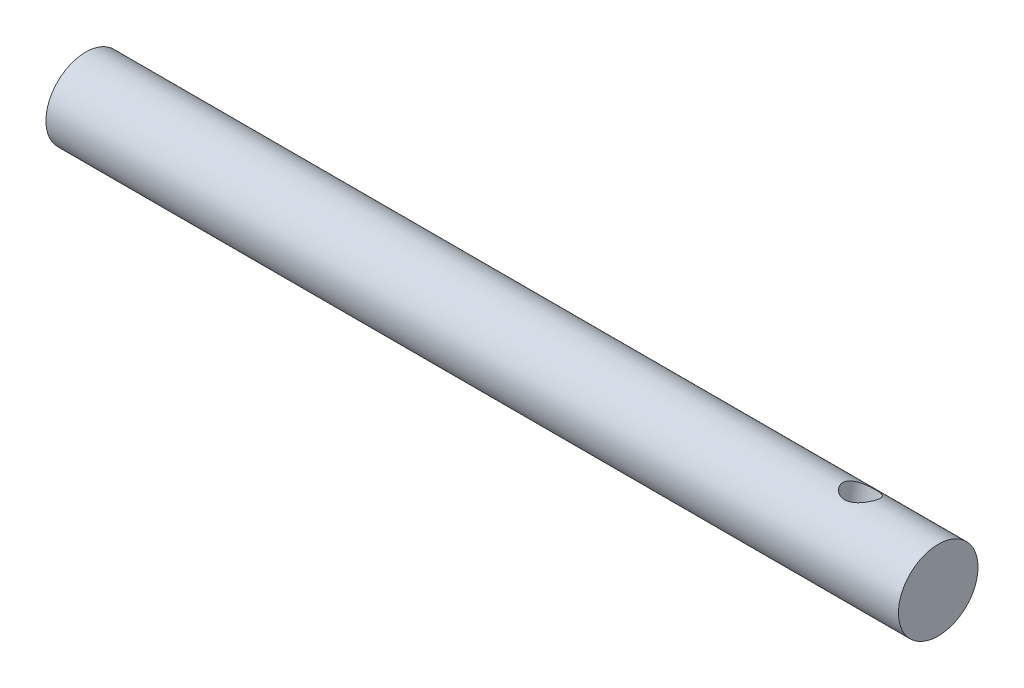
ISO-10303-21;
HEADER;
FILE_DESCRIPTION(('STEP AP214'),'2;1');
FILE_NAME('part.step','',(''),(''),'','','');
FILE_SCHEMA(('AUTOMOTIVE_DESIGN { 1 0 10303 214 1 1 1 1 }'));
ENDSEC;
DATA;
#1=APPLICATION_CONTEXT('core data for automotive mechanical design processes');
#2=APPLICATION_PROTOCOL_DEFINITION('international standard','automotive_design',2000,#1);
#3=PRODUCT_CONTEXT('',#1,'mechanical');
#4=PRODUCT('Part','Part','',(#3));
#5=PRODUCT_RELATED_PRODUCT_CATEGORY('part','',(#4));
#6=PRODUCT_DEFINITION_FORMATION('','',#4);
#7=PRODUCT_DEFINITION_CONTEXT('part definition',#1,'design');
#8=PRODUCT_DEFINITION('design','',#6,#7);
#9=PRODUCT_DEFINITION_SHAPE('','',#8);
#10=(LENGTH_UNIT() NAMED_UNIT(*) SI_UNIT(.MILLI.,.METRE.));
#11=(NAMED_UNIT(*) PLANE_ANGLE_UNIT() SI_UNIT($,.RADIAN.));
#12=(NAMED_UNIT(*) SI_UNIT($,.STERADIAN.) SOLID_ANGLE_UNIT());
#13=UNCERTAINTY_MEASURE_WITH_UNIT(LENGTH_MEASURE(1.E-05),#10,'distance_accuracy_value','');
#14=(GEOMETRIC_REPRESENTATION_CONTEXT(3) GLOBAL_UNCERTAINTY_ASSIGNED_CONTEXT((#13)) GLOBAL_UNIT_ASSIGNED_CONTEXT((#10,
#11,#12)) REPRESENTATION_CONTEXT('',''));
#15=CARTESIAN_POINT('',(0.,0.,0.));
#16=DIRECTION('',(0.,0.,1.));
#17=DIRECTION('',(1.,0.,0.));
#18=AXIS2_PLACEMENT_3D('',#15,#16,#17);
#19=CARTESIAN_POINT('',(228.6,21.5873319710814,31.6861267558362));
#20=DIRECTION('',(-1.,0.,0.));
#21=DIRECTION('',(0.,0.,1.));
#22=AXIS2_PLACEMENT_3D('',#19,#20,#21);
#23=CYLINDRICAL_SURFACE('',#22,10.668);
#24=CARTESIAN_POINT('',(16.3923500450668,11.7176236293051,27.6370427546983));
#25=CARTESIAN_POINT('',(16.2788361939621,11.7176228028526,27.6370436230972));
#26=CARTESIAN_POINT('',(16.1652863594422,11.7157290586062,27.6416512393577));
#27=CARTESIAN_POINT('',(15.9390076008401,11.7082174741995,27.6600348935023));
#28=CARTESIAN_POINT('',(15.826279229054,11.7025973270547,27.673816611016));
#29=CARTESIAN_POINT('',(15.6022965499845,11.6878098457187,27.7104409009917));
#30=CARTESIAN_POINT('',(15.491045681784,11.6786353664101,27.7333017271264));
#31=CARTESIAN_POINT('',(15.2710312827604,11.65705466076,27.7878365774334));
#32=CARTESIAN_POINT('',(15.1622688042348,11.6446470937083,27.8195142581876));
#33=CARTESIAN_POINT('',(14.8417218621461,11.6032693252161,27.9270489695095));
#34=CARTESIAN_POINT('',(14.6345841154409,11.5700656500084,28.0155895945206));
#35=CARTESIAN_POINT('',(14.2381543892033,11.4963138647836,28.22351640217));
#36=CARTESIAN_POINT('',(14.0488583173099,11.4557674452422,28.3428954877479));
#37=CARTESIAN_POINT('',(13.6825785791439,11.3695168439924,28.6162705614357));
#38=CARTESIAN_POINT('',(13.5067158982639,11.3236550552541,28.7717219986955));
#39=CARTESIAN_POINT('',(13.182597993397,11.2336571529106,29.1096569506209));
#40=CARTESIAN_POINT('',(13.0343523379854,11.1895216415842,29.2921497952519));
#41=CARTESIAN_POINT('',(12.76412321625,11.1061853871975,29.6875978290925));
#42=CARTESIAN_POINT('',(12.643378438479,11.0672417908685,29.9014587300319));
#43=CARTESIAN_POINT('',(12.4399276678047,11.0011514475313,30.3482584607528));
#44=CARTESIAN_POINT('',(12.3572064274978,10.9739999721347,30.581189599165));
#45=CARTESIAN_POINT('',(12.236144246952,10.9360069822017,31.0476791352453));
#46=CARTESIAN_POINT('',(12.1958734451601,10.924448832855,31.2806769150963));
#47=CARTESIAN_POINT('',(12.1546452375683,10.9169440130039,31.7503429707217));
#48=CARTESIAN_POINT('',(12.1536734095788,10.9209916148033,31.9870098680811));
#49=CARTESIAN_POINT('',(12.190004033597,10.943922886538,32.4433713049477));
#50=CARTESIAN_POINT('',(12.2251930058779,10.9619737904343,32.663280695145));
#51=CARTESIAN_POINT('',(12.3292566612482,11.0103615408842,33.0935393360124));
#52=CARTESIAN_POINT('',(12.3981338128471,11.0406992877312,33.3038878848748));
#53=CARTESIAN_POINT('',(12.5684679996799,11.1115348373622,33.7128616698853));
#54=CARTESIAN_POINT('',(12.6703988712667,11.1521784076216,33.9112633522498));
#55=CARTESIAN_POINT('',(12.9035064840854,11.2398052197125,34.2885252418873));
#56=CARTESIAN_POINT('',(13.0346931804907,11.2867906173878,34.4673787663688));
#57=CARTESIAN_POINT('',(13.3324907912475,11.3861342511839,34.8128117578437));
#58=CARTESIAN_POINT('',(13.5008452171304,11.4386433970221,34.9778470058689));
#59=CARTESIAN_POINT('',(13.8632077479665,11.5409457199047,35.2779992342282));
#60=CARTESIAN_POINT('',(14.0572239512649,11.5907380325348,35.4131067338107));
#61=CARTESIAN_POINT('',(14.4721866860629,11.6834612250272,35.6530675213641));
#62=CARTESIAN_POINT('',(14.6937257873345,11.7261665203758,35.7569896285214));
#63=CARTESIAN_POINT('',(15.1533389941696,11.7974990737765,35.925688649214));
#64=CARTESIAN_POINT('',(15.3914024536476,11.8261353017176,35.990490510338));
#65=CARTESIAN_POINT('',(15.861949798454,11.8640663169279,36.075475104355));
#66=CARTESIAN_POINT('',(16.0939032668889,11.8744241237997,36.0981147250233));
#67=CARTESIAN_POINT('',(16.5584888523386,11.8776910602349,36.105304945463));
#68=CARTESIAN_POINT('',(16.791120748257,11.8706053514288,36.0898668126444));
#69=CARTESIAN_POINT('',(17.2368473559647,11.8408432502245,36.0235627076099));
#70=CARTESIAN_POINT('',(17.4503086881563,11.8190568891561,35.9747171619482));
#71=CARTESIAN_POINT('',(17.865803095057,11.7633704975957,35.8455635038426));
#72=CARTESIAN_POINT('',(18.0678336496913,11.7294678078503,35.7652484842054));
#73=CARTESIAN_POINT('',(18.4637821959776,11.6515792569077,35.5717799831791));
#74=CARTESIAN_POINT('',(18.6570479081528,11.6072429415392,35.4574365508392));
#75=CARTESIAN_POINT('',(19.0223821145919,11.5138306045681,35.2003099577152));
#76=CARTESIAN_POINT('',(19.1944420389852,11.464752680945,35.0575153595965));
#77=CARTESIAN_POINT('',(19.5254398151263,11.3628695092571,34.7352459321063));
#78=CARTESIAN_POINT('',(19.6825227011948,11.3100519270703,34.5538626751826));
#79=CARTESIAN_POINT('',(19.9641396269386,11.2096470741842,34.1660369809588));
#80=CARTESIAN_POINT('',(20.0886725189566,11.1620599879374,33.9595936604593));
#81=CARTESIAN_POINT('',(20.3011409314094,11.0770249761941,33.5268340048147));
#82=CARTESIAN_POINT('',(20.3891024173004,11.039569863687,33.3005319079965));
#83=CARTESIAN_POINT('',(20.525025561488,10.9787180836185,32.8344468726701));
#84=CARTESIAN_POINT('',(20.573008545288,10.9553139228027,32.5946711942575));
#85=CARTESIAN_POINT('',(20.6251091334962,10.9259373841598,32.1250660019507));
#86=CARTESIAN_POINT('',(20.6318510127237,10.9189400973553,31.8955894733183));
#87=CARTESIAN_POINT('',(20.6081847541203,10.9197577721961,31.4386146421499));
#88=CARTESIAN_POINT('',(20.5777820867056,10.9275705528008,31.2111160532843));
#89=CARTESIAN_POINT('',(20.4825619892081,10.9563926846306,30.7715332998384));
#90=CARTESIAN_POINT('',(20.4187993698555,10.9770009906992,30.5591916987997));
#91=CARTESIAN_POINT('',(20.2597700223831,11.0287562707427,30.1480503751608));
#92=CARTESIAN_POINT('',(20.164497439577,11.0599052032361,29.9492531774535));
#93=CARTESIAN_POINT('',(19.9404264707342,11.1311432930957,29.5612840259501));
#94=CARTESIAN_POINT('',(19.8103383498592,11.1715652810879,29.3729194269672));
#95=CARTESIAN_POINT('',(19.5222748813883,11.2563049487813,29.0198314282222));
#96=CARTESIAN_POINT('',(19.3642882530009,11.3006242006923,28.8551176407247));
#97=CARTESIAN_POINT('',(19.0135557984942,11.3912806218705,28.5437307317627));
#98=CARTESIAN_POINT('',(18.8192819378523,11.4375769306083,28.3987601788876));
#99=CARTESIAN_POINT('',(18.4077955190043,11.5238291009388,28.1434786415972));
#100=CARTESIAN_POINT('',(18.1905801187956,11.5637841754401,28.0331719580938));
#101=CARTESIAN_POINT('',(17.758762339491,11.6289759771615,27.85921012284));
#102=CARTESIAN_POINT('',(17.5456442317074,11.655205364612,27.7922795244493));
#103=CARTESIAN_POINT('',(17.2196495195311,11.6848448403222,27.7177978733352));
#104=CARTESIAN_POINT('',(17.1100230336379,11.6931044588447,27.6972958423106));
#105=CARTESIAN_POINT('',(16.8893038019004,11.7061607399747,27.6650575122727));
#106=CARTESIAN_POINT('',(16.7782119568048,11.7109594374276,27.6533160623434));
#107=CARTESIAN_POINT('',(16.6211468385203,11.7151695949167,27.6430289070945));
#108=CARTESIAN_POINT('',(16.5754249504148,11.7160890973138,27.6407849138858));
#109=CARTESIAN_POINT('',(16.4839206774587,11.7173163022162,27.637791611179));
#110=CARTESIAN_POINT('',(16.4381382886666,11.7176239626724,27.637042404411));
#111=CARTESIAN_POINT('',(16.3923500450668,11.7176236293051,27.6370427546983));
#112=B_SPLINE_CURVE_WITH_KNOTS('',3,(#24,#25,#26,#27,#28,#29,#30,#31,#32,#33,#34,#35,#36,#37,
#38,#39,#40,#41,#42,#43,#44,#45,#46,#47,#48,#49,#50,#51,#52,#53,#54,#55,#56,#57,#58,#59,#60,#61,
#62,#63,#64,#65,#66,#67,#68,#69,#70,#71,#72,#73,#74,#75,#76,#77,#78,#79,#80,#81,#82,#83,#84,#85,
#86,#87,#88,#89,#90,#91,#92,#93,#94,#95,#96,#97,#98,#99,#100,#101,#102,#103,#104,#105,#106,#107,
#108,#109,#110,#111),.UNSPECIFIED.,.T.,.F.,(4,2,2,2,2,2,2,2,2,2,2,2,2,2,2,2,2,2,2,2,2,2,2,2,2,2,
2,2,2,2,2,2,2,2,2,2,2,2,2,2,2,2,2,4),(0.,0.340494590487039,0.681200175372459,1.02259424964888,
1.36413012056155,2.04390922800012,2.7235320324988,3.43783050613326,4.15237600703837,
4.89458039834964,5.6364869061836,6.34298137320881,7.04921656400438,7.71639909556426,
8.38363052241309,9.06088431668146,9.73836891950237,10.4597133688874,11.1812860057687,
11.9226447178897,12.6635301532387,13.3597003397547,14.0556645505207,14.7128785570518,
15.3702368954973,16.0540119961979,16.7380625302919,17.4716928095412,18.2053489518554,
18.9384833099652,19.6712263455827,20.3568128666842,21.0422984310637,21.7073139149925,
22.3724530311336,23.0668330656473,23.7614945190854,24.4983331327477,25.235263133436,
25.9066827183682,26.2418500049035,26.5768200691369,26.714156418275,26.8515022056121),.UNSPECIFIED.);
#113=CARTESIAN_POINT('',(16.3923500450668,11.7176236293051,27.6370427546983));
#114=VERTEX_POINT('',#113);
#115=EDGE_CURVE('E10',#114,#114,#112,.T.);
#116=ORIENTED_EDGE('',*,*,#115,.T.);
#117=EDGE_LOOP('',(#116));
#118=FACE_BOUND('',#117,.T.);
#119=CARTESIAN_POINT('',(46.8697273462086,11.876290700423,27.2700310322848));
#120=CARTESIAN_POINT('',(46.7562134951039,11.8762898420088,27.2700318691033));
#121=CARTESIAN_POINT('',(46.642663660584,11.8742247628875,27.2745652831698));
#122=CARTESIAN_POINT('',(46.4163849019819,11.8660295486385,27.2926545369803));
#123=CARTESIAN_POINT('',(46.3036565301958,11.8598968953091,27.3062159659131));
#124=CARTESIAN_POINT('',(46.0796738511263,11.8437473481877,27.3422603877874));
#125=CARTESIAN_POINT('',(45.9684229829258,11.8337226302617,27.3647613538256));
#126=CARTESIAN_POINT('',(45.7484085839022,11.810113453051,27.4184491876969));
#127=CARTESIAN_POINT('',(45.6396461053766,11.7965275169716,27.4496396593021));
#128=CARTESIAN_POINT('',(45.3190991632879,11.7511490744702,27.55554825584));
#129=CARTESIAN_POINT('',(45.1119614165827,11.7146507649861,27.6427824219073));
#130=CARTESIAN_POINT('',(44.7155316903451,11.6331589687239,27.8477994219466));
#131=CARTESIAN_POINT('',(44.5262356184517,11.5881674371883,27.9655752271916));
#132=CARTESIAN_POINT('',(44.1599558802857,11.4917330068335,28.2355261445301));
#133=CARTESIAN_POINT('',(43.9840931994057,11.440078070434,28.3891497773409));
#134=CARTESIAN_POINT('',(43.6599752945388,11.3374796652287,28.7234748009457));
#135=CARTESIAN_POINT('',(43.5117296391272,11.286536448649,28.9041855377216));
#136=CARTESIAN_POINT('',(43.2415005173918,11.1884397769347,29.2962328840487));
#137=CARTESIAN_POINT('',(43.1207557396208,11.1415093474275,29.508484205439));
#138=CARTESIAN_POINT('',(42.9173049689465,11.058722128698,29.9524934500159));
#139=CARTESIAN_POINT('',(42.8345837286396,11.0228609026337,30.1842435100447));
#140=CARTESIAN_POINT('',(42.7135215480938,10.9674134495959,30.6489816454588));
#141=CARTESIAN_POINT('',(42.6732507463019,10.9471320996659,30.8813826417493));
#142=CARTESIAN_POINT('',(42.6320225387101,10.9220323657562,31.3504375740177));
#143=CARTESIAN_POINT('',(42.6310507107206,10.917208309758,31.5870899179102));
#144=CARTESIAN_POINT('',(42.6673813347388,10.9230218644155,32.0439901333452));
#145=CARTESIAN_POINT('',(42.7025703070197,10.9328192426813,32.2644214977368));
#146=CARTESIAN_POINT('',(42.80663396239,10.9650495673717,32.696191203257));
#147=CARTESIAN_POINT('',(42.8755111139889,10.9874834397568,32.9075288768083));
#148=CARTESIAN_POINT('',(43.0458453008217,11.0429434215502,33.3188698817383));
#149=CARTESIAN_POINT('',(43.1477761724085,11.0761235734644,33.5186552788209));
#150=CARTESIAN_POINT('',(43.3808837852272,11.1495513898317,33.8989358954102));
#151=CARTESIAN_POINT('',(43.5120704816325,11.1898014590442,34.0794245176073));
#152=CARTESIAN_POINT('',(43.8098680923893,11.2761306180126,34.4283376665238));
#153=CARTESIAN_POINT('',(43.9782225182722,11.3224183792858,34.5952247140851));
#154=CARTESIAN_POINT('',(44.3405850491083,11.4134009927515,34.8989997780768));
#155=CARTESIAN_POINT('',(44.5346012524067,11.4580953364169,35.035878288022));
#156=CARTESIAN_POINT('',(44.9495639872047,11.5417611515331,35.2791452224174));
#157=CARTESIAN_POINT('',(45.1711030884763,11.5805420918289,35.3845946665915));
#158=CARTESIAN_POINT('',(45.6307162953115,11.6455027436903,35.5558482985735));
#159=CARTESIAN_POINT('',(45.8687797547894,11.6716904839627,35.6216777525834));
#160=CARTESIAN_POINT('',(46.3393270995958,11.7064101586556,35.7080240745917));
#161=CARTESIAN_POINT('',(46.5712805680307,11.7159122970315,35.731035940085));
#162=CARTESIAN_POINT('',(47.0358661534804,11.7189074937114,35.7383435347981));
#163=CARTESIAN_POINT('',(47.2684980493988,11.7124052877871,35.7226507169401));
#164=CARTESIAN_POINT('',(47.7142246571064,11.6851487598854,35.6552778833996));
#165=CARTESIAN_POINT('',(47.9276859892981,11.6652081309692,35.6056502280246));
#166=CARTESIAN_POINT('',(48.3431803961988,11.6144007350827,35.4745005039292));
#167=CARTESIAN_POINT('',(48.5452109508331,11.5835315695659,35.3929714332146));
#168=CARTESIAN_POINT('',(48.9411594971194,11.5129477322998,35.1967200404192));
#169=CARTESIAN_POINT('',(49.1344252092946,11.4729274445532,35.0807954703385));
#170=CARTESIAN_POINT('',(49.4997594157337,11.3892162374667,34.8203489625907));
#171=CARTESIAN_POINT('',(49.671819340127,11.3455238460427,34.6758155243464));
#172=CARTESIAN_POINT('',(50.0028171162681,11.2557889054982,34.3499545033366));
#173=CARTESIAN_POINT('',(50.1599000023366,11.2098055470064,34.1667193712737));
#174=CARTESIAN_POINT('',(50.4415169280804,11.1240045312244,33.7754035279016));
#175=CARTESIAN_POINT('',(50.5660498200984,11.0841870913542,33.5673219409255));
#176=CARTESIAN_POINT('',(50.7785182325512,11.0154289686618,33.1316796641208));
#177=CARTESIAN_POINT('',(50.8664797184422,10.9864805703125,32.9041329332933));
#178=CARTESIAN_POINT('',(51.0024028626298,10.9431375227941,32.4360949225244));
#179=CARTESIAN_POINT('',(51.0503858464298,10.9287351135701,32.1956106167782));
#180=CARTESIAN_POINT('',(51.102486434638,10.9169771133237,31.7252344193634));
#181=CARTESIAN_POINT('',(51.1092283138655,10.918584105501,31.4956568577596));
#182=CARTESIAN_POINT('',(51.0855620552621,10.9365258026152,31.039033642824));
#183=CARTESIAN_POINT('',(51.0551593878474,10.9528583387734,30.8119876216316));
#184=CARTESIAN_POINT('',(50.9599392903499,10.9981330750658,30.3737937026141));
#185=CARTESIAN_POINT('',(50.8961766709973,11.0266841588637,30.1623735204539));
#186=CARTESIAN_POINT('',(50.7371473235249,11.09381012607,29.753460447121));
#187=CARTESIAN_POINT('',(50.6418747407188,11.1323868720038,29.555970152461));
#188=CARTESIAN_POINT('',(50.417803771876,11.2181136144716,29.1709430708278));
#189=CARTESIAN_POINT('',(50.2877156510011,11.2655659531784,28.9842255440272));
#190=CARTESIAN_POINT('',(49.9996521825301,11.363477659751,28.6345610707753));
#191=CARTESIAN_POINT('',(49.8416655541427,11.4139382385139,28.4716237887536));
#192=CARTESIAN_POINT('',(49.490933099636,11.5161998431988,28.1638528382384));
#193=CARTESIAN_POINT('',(49.2966592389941,11.5678962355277,28.0207190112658));
#194=CARTESIAN_POINT('',(48.8851728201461,11.6636541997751,27.7688489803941));
#195=CARTESIAN_POINT('',(48.6679574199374,11.7077148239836,27.6601170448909));
#196=CARTESIAN_POINT('',(48.2361396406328,11.7793798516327,27.4887203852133));
#197=CARTESIAN_POINT('',(48.0230215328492,11.8080989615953,27.4228197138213));
#198=CARTESIAN_POINT('',(47.6970268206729,11.8405087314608,27.3495010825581));
#199=CARTESIAN_POINT('',(47.5874003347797,11.8495308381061,27.329322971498));
#200=CARTESIAN_POINT('',(47.3666811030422,11.8637860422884,27.2975965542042));
#201=CARTESIAN_POINT('',(47.2555892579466,11.8690213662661,27.2860431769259));
#202=CARTESIAN_POINT('',(47.0985241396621,11.8736140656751,27.2759210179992));
#203=CARTESIAN_POINT('',(47.0528022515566,11.8746170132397,27.2737130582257));
#204=CARTESIAN_POINT('',(46.9612979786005,11.8759555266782,27.270767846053));
#205=CARTESIAN_POINT('',(46.9155155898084,11.8762910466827,27.2700306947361));
#206=CARTESIAN_POINT('',(46.8697273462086,11.876290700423,27.2700310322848));
#207=B_SPLINE_CURVE_WITH_KNOTS('',3,(#119,#120,#121,#122,#123,#124,#125,#126,#127,#128,#129,
#130,#131,#132,#133,#134,#135,#136,#137,#138,#139,#140,#141,#142,#143,#144,#145,#146,#147,#148,
#149,#150,#151,#152,#153,#154,#155,#156,#157,#158,#159,#160,#161,#162,#163,#164,#165,#166,#167,
#168,#169,#170,#171,#172,#173,#174,#175,#176,#177,#178,#179,#180,#181,#182,#183,#184,#185,#186,
#187,#188,#189,#190,#191,#192,#193,#194,#195,#196,#197,#198,#199,#200,#201,#202,#203,#204,#205,
#206),.UNSPECIFIED.,.T.,.F.,(4,2,2,2,2,2,2,2,2,2,2,2,2,2,2,2,2,2,2,2,2,2,2,2,2,2,2,2,2,2,2,2,2,
2,2,2,2,2,2,2,2,2,2,4),(0.,0.340494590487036,0.681200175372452,1.02259424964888,
1.36413012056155,2.04390922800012,2.7235320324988,3.43783050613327,4.15237600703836,
4.89458039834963,5.6364869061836,6.34298137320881,7.04921656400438,7.71639909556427,
8.38363052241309,9.06088431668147,9.73836891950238,10.4597133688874,11.1812860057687,
11.9226447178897,12.6635301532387,13.3597003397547,14.0556645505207,14.7128785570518,
15.3702368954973,16.0540119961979,16.7380625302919,17.4716928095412,18.2053489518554,
18.9384833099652,19.6712263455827,20.3568128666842,21.0422984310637,21.7073139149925,
22.3724530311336,23.0668330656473,23.7614945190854,24.4983331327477,25.235263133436,
25.9066827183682,26.2418500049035,26.5768200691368,26.714156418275,26.8515022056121),.UNSPECIFIED.);
#208=CARTESIAN_POINT('',(46.8697273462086,11.876290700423,27.2700310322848));
#209=VERTEX_POINT('',#208);
#210=EDGE_CURVE('E39',#209,#209,#207,.T.);
#211=ORIENTED_EDGE('',*,*,#210,.T.);
#212=EDGE_LOOP('',(#211));
#213=FACE_BOUND('',#212,.T.);
#214=CARTESIAN_POINT('',(78.6096514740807,11.5727244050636,28.0100066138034));
#215=CARTESIAN_POINT('',(78.496137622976,11.5727236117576,28.0100075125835));
#216=CARTESIAN_POINT('',(78.3825877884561,11.5710039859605,28.0146829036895));
#217=CARTESIAN_POINT('',(78.156309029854,11.564187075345,28.0333353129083));
#218=CARTESIAN_POINT('',(78.0435806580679,11.5590876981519,28.0473180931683));
#219=CARTESIAN_POINT('',(77.8195979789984,11.5456840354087,28.0844711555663));
#220=CARTESIAN_POINT('',(77.7083471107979,11.5373732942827,28.107659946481));
#221=CARTESIAN_POINT('',(77.4883327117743,11.5178528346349,28.1629657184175));
#222=CARTESIAN_POINT('',(77.3795702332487,11.5066419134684,28.1950864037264));
#223=CARTESIAN_POINT('',(77.0590232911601,11.4693258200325,28.3040971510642));
#224=CARTESIAN_POINT('',(76.8518855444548,11.4394657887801,28.3938206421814));
#225=CARTESIAN_POINT('',(76.4554558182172,11.3735631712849,28.604366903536));
#226=CARTESIAN_POINT('',(76.2661597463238,11.3375220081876,28.7251825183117));
#227=CARTESIAN_POINT('',(75.8998800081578,11.2615836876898,29.0015997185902));
#228=CARTESIAN_POINT('',(75.7240173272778,11.221583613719,29.1586616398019));
#229=CARTESIAN_POINT('',(75.399899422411,11.1443216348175,29.4997338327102));
#230=CARTESIAN_POINT('',(75.2516537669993,11.1070606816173,29.683753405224));
#231=CARTESIAN_POINT('',(74.9814246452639,11.0386124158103,30.0820484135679));
#232=CARTESIAN_POINT('',(74.8606798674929,11.0077160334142,30.2972192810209));
#233=CARTESIAN_POINT('',(74.6572290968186,10.958427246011,30.746183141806));
#234=CARTESIAN_POINT('',(74.5745078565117,10.9400298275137,30.979968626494));
#235=CARTESIAN_POINT('',(74.4534456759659,10.9195570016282,31.4475547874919));
#236=CARTESIAN_POINT('',(74.413174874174,10.9167444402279,31.6808221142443));
#237=CARTESIAN_POINT('',(74.3719466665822,10.9268574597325,32.1504392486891));
#238=CARTESIAN_POINT('',(74.3709748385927,10.9397772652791,32.3867878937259));
#239=CARTESIAN_POINT('',(74.4073054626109,10.9798060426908,32.841968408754));
#240=CARTESIAN_POINT('',(74.4424944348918,11.006090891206,33.0610462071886));
#241=CARTESIAN_POINT('',(74.5465580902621,11.0705793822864,33.4891876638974));
#242=CARTESIAN_POINT('',(74.615435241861,11.1087838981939,33.6982505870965));
#243=CARTESIAN_POINT('',(74.7857694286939,11.1949062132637,34.1042803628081));
#244=CARTESIAN_POINT('',(74.8877003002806,11.2429612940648,34.3010183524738));
#245=CARTESIAN_POINT('',(75.1208079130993,11.3446738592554,34.674728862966));
#246=CARTESIAN_POINT('',(75.2519946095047,11.3983332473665,34.8516946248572));
#247=CARTESIAN_POINT('',(75.5497922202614,11.5105608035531,35.1931592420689));
#248=CARTESIAN_POINT('',(75.7181466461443,11.5692218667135,35.3561093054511));
#249=CARTESIAN_POINT('',(76.0805091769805,11.6827079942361,35.6522140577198));
#250=CARTESIAN_POINT('',(76.2745253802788,11.7375318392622,35.785359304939));
#251=CARTESIAN_POINT('',(76.6894881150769,11.839188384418,36.0216741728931));
#252=CARTESIAN_POINT('',(76.9110272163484,11.8857607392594,36.1239217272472));
#253=CARTESIAN_POINT('',(77.3706404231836,11.9633693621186,36.2898271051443));
#254=CARTESIAN_POINT('',(77.6087038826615,11.9944155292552,36.3535095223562));
#255=CARTESIAN_POINT('',(78.079251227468,12.0355068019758,36.4370119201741));
#256=CARTESIAN_POINT('',(78.3112046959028,12.0467063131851,36.4592471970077));
#257=CARTESIAN_POINT('',(78.7757902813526,12.0502405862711,36.4663098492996));
#258=CARTESIAN_POINT('',(79.0084221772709,12.0425809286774,36.4511482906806));
#259=CARTESIAN_POINT('',(79.4541487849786,12.0103533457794,36.3860069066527));
#260=CARTESIAN_POINT('',(79.6676101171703,11.9867505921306,36.3380127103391));
#261=CARTESIAN_POINT('',(80.0831045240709,11.9262600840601,36.2110381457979));
#262=CARTESIAN_POINT('',(80.2851350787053,11.8893694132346,36.1320509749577));
#263=CARTESIAN_POINT('',(80.6810836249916,11.8042805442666,35.9416393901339));
#264=CARTESIAN_POINT('',(80.8743493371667,11.7556875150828,35.8290390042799));
#265=CARTESIAN_POINT('',(81.2396835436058,11.652698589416,35.5755962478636));
#266=CARTESIAN_POINT('',(81.4117434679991,11.5983003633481,35.4347425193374));
#267=CARTESIAN_POINT('',(81.7427412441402,11.4844036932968,35.1165204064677));
#268=CARTESIAN_POINT('',(81.8998241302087,11.4248213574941,34.9372453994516));
#269=CARTESIAN_POINT('',(82.1814410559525,11.3099435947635,34.5534576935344));
#270=CARTESIAN_POINT('',(82.3059739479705,11.2546483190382,34.348944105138));
#271=CARTESIAN_POINT('',(82.5184423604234,11.1534445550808,33.91967767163));
#272=CARTESIAN_POINT('',(82.6064038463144,11.1075294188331,33.6949393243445));
#273=CARTESIAN_POINT('',(82.7423269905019,11.0292421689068,33.2314640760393));
#274=CARTESIAN_POINT('',(82.790309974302,10.9968628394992,32.9927347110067));
#275=CARTESIAN_POINT('',(82.8424105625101,10.9498966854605,32.5245614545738));
#276=CARTESIAN_POINT('',(82.8491524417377,10.9342989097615,32.2955087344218));
#277=CARTESIAN_POINT('',(82.8254861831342,10.9179793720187,31.83882466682));
#278=CARTESIAN_POINT('',(82.7950835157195,10.917255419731,31.6111931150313));
#279=CARTESIAN_POINT('',(82.699863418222,10.9295728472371,31.1708387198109));
#280=CARTESIAN_POINT('',(82.6361007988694,10.9422038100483,30.9578736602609));
#281=CARTESIAN_POINT('',(82.477071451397,10.9785048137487,30.5450806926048));
#282=CARTESIAN_POINT('',(82.3817988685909,11.002176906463,30.345255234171));
#283=CARTESIAN_POINT('',(82.1577278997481,11.0588159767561,29.9548875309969));
#284=CARTESIAN_POINT('',(82.0276397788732,11.092145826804,29.7651395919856));
#285=CARTESIAN_POINT('',(81.7395763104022,11.1635850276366,29.4091221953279));
#286=CARTESIAN_POINT('',(81.5815896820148,11.2016963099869,29.2428622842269));
#287=CARTESIAN_POINT('',(81.2308572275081,11.2806119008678,28.9282947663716));
#288=CARTESIAN_POINT('',(81.0365833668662,11.3214392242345,28.7816900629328));
#289=CARTESIAN_POINT('',(80.6250969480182,11.3980576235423,28.5233536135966));
#290=CARTESIAN_POINT('',(80.4078815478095,11.4338480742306,28.4116261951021));
#291=CARTESIAN_POINT('',(79.9760637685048,11.4924704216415,28.2353420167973));
#292=CARTESIAN_POINT('',(79.7629456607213,11.5161714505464,28.1674748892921));
#293=CARTESIAN_POINT('',(79.436950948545,11.5429970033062,28.0919341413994));
#294=CARTESIAN_POINT('',(79.3273244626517,11.5504819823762,28.07113679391));
#295=CARTESIAN_POINT('',(79.1066052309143,11.5623201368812,28.0384315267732));
#296=CARTESIAN_POINT('',(78.9955133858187,11.5666751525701,28.0265183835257));
#297=CARTESIAN_POINT('',(78.8384482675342,11.5704965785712,28.0160805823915));
#298=CARTESIAN_POINT('',(78.7927263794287,11.5713312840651,28.0138036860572));
#299=CARTESIAN_POINT('',(78.7012221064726,11.5724453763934,28.0107664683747));
#300=CARTESIAN_POINT('',(78.6554397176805,11.5727247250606,28.0100062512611));
#301=CARTESIAN_POINT('',(78.6096514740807,11.5727244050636,28.0100066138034));
#302=B_SPLINE_CURVE_WITH_KNOTS('',3,(#214,#215,#216,#217,#218,#219,#220,#221,#222,#223,#224,
#225,#226,#227,#228,#229,#230,#231,#232,#233,#234,#235,#236,#237,#238,#239,#240,#241,#242,#243,
#244,#245,#246,#247,#248,#249,#250,#251,#252,#253,#254,#255,#256,#257,#258,#259,#260,#261,#262,
#263,#264,#265,#266,#267,#268,#269,#270,#271,#272,#273,#274,#275,#276,#277,#278,#279,#280,#281,
#282,#283,#284,#285,#286,#287,#288,#289,#290,#291,#292,#293,#294,#295,#296,#297,#298,#299,#300,
#301),.UNSPECIFIED.,.T.,.F.,(4,2,2,2,2,2,2,2,2,2,2,2,2,2,2,2,2,2,2,2,2,2,2,2,2,2,2,2,2,2,2,2,2,
2,2,2,2,2,2,2,2,2,2,4),(0.,0.34049459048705,0.681200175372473,1.02259424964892,1.36413012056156,
2.04390922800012,2.72353203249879,3.43783050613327,4.15237600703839,4.89458039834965,
5.63648690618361,6.34298137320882,7.04921656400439,7.71639909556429,8.3836305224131,
9.06088431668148,9.73836891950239,10.4597133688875,11.1812860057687,11.9226447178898,
12.6635301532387,13.3597003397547,14.0556645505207,14.7128785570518,15.3702368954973,
16.0540119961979,16.7380625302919,17.4716928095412,18.2053489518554,18.9384833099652,
19.6712263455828,20.3568128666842,21.0422984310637,21.7073139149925,22.3724530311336,
23.0668330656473,23.7614945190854,24.4983331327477,25.235263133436,25.9066827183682,
26.2418500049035,26.5768200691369,26.714156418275,26.8515022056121),.UNSPECIFIED.);
#303=CARTESIAN_POINT('',(78.6096514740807,11.5727244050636,28.0100066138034));
#304=VERTEX_POINT('',#303);
#305=EDGE_CURVE('E79',#304,#304,#302,.T.);
#306=ORIENTED_EDGE('',*,*,#305,.T.);
#307=EDGE_LOOP('',(#306));
#308=FACE_BOUND('',#307,.T.);
#309=CARTESIAN_POINT('',(115.420112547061,12.0487256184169,26.9089714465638));
#310=CARTESIAN_POINT('',(115.306598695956,12.0487247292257,26.9089722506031));
#311=CARTESIAN_POINT('',(115.193048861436,12.0464910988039,26.9134250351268));
#312=CARTESIAN_POINT('',(114.966770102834,12.0376232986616,26.9311942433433));
#313=CARTESIAN_POINT('',(114.854041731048,12.030986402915,26.9445161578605));
#314=CARTESIAN_POINT('',(114.630059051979,12.0134965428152,26.9799296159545));
#315=CARTESIAN_POINT('',(114.518808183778,12.0026350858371,27.0020388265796));
#316=CARTESIAN_POINT('',(114.298793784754,11.9770292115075,27.0548035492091));
#317=CARTESIAN_POINT('',(114.190031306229,11.9622831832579,27.0854626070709));
#318=CARTESIAN_POINT('',(113.86948436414,11.9129650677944,27.1895950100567));
#319=CARTESIAN_POINT('',(113.662346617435,11.8732211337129,27.2753991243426));
#320=CARTESIAN_POINT('',(113.265916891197,11.7840984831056,27.4772159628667));
#321=CARTESIAN_POINT('',(113.076620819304,11.7347219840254,27.5932217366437));
#322=CARTESIAN_POINT('',(112.710341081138,11.628232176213,27.8593664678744));
#323=CARTESIAN_POINT('',(112.534478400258,11.5708526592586,28.0109449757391));
#324=CARTESIAN_POINT('',(112.210360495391,11.4557891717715,28.3411873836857));
#325=CARTESIAN_POINT('',(112.062114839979,11.3981051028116,28.5198606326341));
#326=CARTESIAN_POINT('',(111.791885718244,11.2853755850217,28.9079535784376));
#327=CARTESIAN_POINT('',(111.671140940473,11.230518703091,29.1182957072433));
#328=CARTESIAN_POINT('',(111.467690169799,11.1311392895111,29.5588881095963));
#329=CARTESIAN_POINT('',(111.384968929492,11.0866126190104,29.7891303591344));
#330=CARTESIAN_POINT('',(111.263906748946,11.0137764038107,30.2514623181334));
#331=CARTESIAN_POINT('',(111.223635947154,10.9847942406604,30.4829392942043));
#332=CARTESIAN_POINT('',(111.182407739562,10.9421225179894,30.9507230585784));
#333=CARTESIAN_POINT('',(111.181435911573,10.9284273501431,31.1870280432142));
#334=CARTESIAN_POINT('',(111.217766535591,10.9171029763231,31.6438248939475));
#335=CARTESIAN_POINT('',(111.252955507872,10.9186272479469,31.864468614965));
#336=CARTESIAN_POINT('',(111.357019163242,10.9346434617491,32.2971432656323));
#337=CARTESIAN_POINT('',(111.425896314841,10.949136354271,32.5091735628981));
#338=CARTESIAN_POINT('',(111.596230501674,10.9891319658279,32.9223049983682));
#339=CARTESIAN_POINT('',(111.698161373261,11.0147967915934,33.1231941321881));
#340=CARTESIAN_POINT('',(111.931268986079,11.0739123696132,33.505960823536));
#341=CARTESIAN_POINT('',(112.062455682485,11.1073657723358,33.6878318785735));
#342=CARTESIAN_POINT('',(112.360253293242,11.1805499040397,34.0397369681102));
#343=CARTESIAN_POINT('',(112.528607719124,11.220546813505,34.2082424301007));
#344=CARTESIAN_POINT('',(112.890970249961,11.3000738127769,34.5152156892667));
#345=CARTESIAN_POINT('',(113.084986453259,11.339603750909,34.6536739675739));
#346=CARTESIAN_POINT('',(113.499949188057,11.414088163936,34.8999072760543));
#347=CARTESIAN_POINT('',(113.721488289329,11.448887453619,35.0067368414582));
#348=CARTESIAN_POINT('',(114.181101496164,11.5073803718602,35.1803060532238));
#349=CARTESIAN_POINT('',(114.419164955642,11.5310810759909,35.2470712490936));
#350=CARTESIAN_POINT('',(114.889712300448,11.5625383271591,35.3346588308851));
#351=CARTESIAN_POINT('',(115.121665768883,11.5711708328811,35.3580108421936));
#352=CARTESIAN_POINT('',(115.586251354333,11.5738898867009,35.3654256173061));
#353=CARTESIAN_POINT('',(115.818883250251,11.5679807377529,35.3495000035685));
#354=CARTESIAN_POINT('',(116.264609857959,11.5432698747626,35.2811524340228));
#355=CARTESIAN_POINT('',(116.47807119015,11.5252043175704,35.2308119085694));
#356=CARTESIAN_POINT('',(116.893565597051,11.4793507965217,35.0978491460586));
#357=CARTESIAN_POINT('',(117.095596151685,11.4515606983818,35.0152198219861));
#358=CARTESIAN_POINT('',(117.491544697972,11.3883859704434,34.8164595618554));
#359=CARTESIAN_POINT('',(117.684810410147,11.3527410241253,34.6991157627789));
#360=CARTESIAN_POINT('',(118.050144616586,11.2788554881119,34.435713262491));
#361=CARTESIAN_POINT('',(118.222204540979,11.2406138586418,34.2896430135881));
#362=CARTESIAN_POINT('',(118.55320231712,11.1631618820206,33.9606461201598));
#363=CARTESIAN_POINT('',(118.710285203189,11.1240822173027,33.7758154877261));
#364=CARTESIAN_POINT('',(118.991902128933,11.0530159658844,33.3815573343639));
#365=CARTESIAN_POINT('',(119.116435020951,11.0210296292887,33.1721289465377));
#366=CARTESIAN_POINT('',(119.328903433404,10.968656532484,32.7342146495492));
#367=CARTESIAN_POINT('',(119.416864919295,10.9482615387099,32.505742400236));
#368=CARTESIAN_POINT('',(119.552788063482,10.9225004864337,32.0364082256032));
#369=CARTESIAN_POINT('',(119.600771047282,10.9171264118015,31.7955529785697));
#370=CARTESIAN_POINT('',(119.65287163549,10.9230158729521,31.325066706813));
#371=CARTESIAN_POINT('',(119.659613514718,10.9332309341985,31.0957108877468));
#372=CARTESIAN_POINT('',(119.635947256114,10.9682834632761,30.6400816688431));
#373=CARTESIAN_POINT('',(119.6055445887,10.9931187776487,30.4138078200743));
#374=CARTESIAN_POINT('',(119.510324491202,11.0547940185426,29.977619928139));
#375=CARTESIAN_POINT('',(119.44656187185,11.0912533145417,29.7674191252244));
#376=CARTESIAN_POINT('',(119.287532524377,11.1736663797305,29.3613109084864));
#377=CARTESIAN_POINT('',(119.192259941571,11.219621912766,29.1654061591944));
#378=CARTESIAN_POINT('',(118.968188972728,11.3197269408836,28.7838646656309));
#379=CARTESIAN_POINT('',(118.838100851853,11.3741478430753,28.5990579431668));
#380=CARTESIAN_POINT('',(118.550037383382,11.4851031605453,28.2533111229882));
#381=CARTESIAN_POINT('',(118.392050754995,11.5416384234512,28.0923807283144));
#382=CARTESIAN_POINT('',(118.041318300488,11.6553695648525,27.7886610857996));
#383=CARTESIAN_POINT('',(117.847044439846,11.7123971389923,27.6475665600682));
#384=CARTESIAN_POINT('',(117.435558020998,11.8175329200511,27.3994646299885));
#385=CARTESIAN_POINT('',(117.21834262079,11.8656400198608,27.2924614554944));
#386=CARTESIAN_POINT('',(116.786524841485,11.9436820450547,27.1238728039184));
#387=CARTESIAN_POINT('',(116.573406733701,11.9748522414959,27.0590954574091));
#388=CARTESIAN_POINT('',(116.247412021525,12.0099886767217,26.9870437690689));
#389=CARTESIAN_POINT('',(116.137785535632,12.01976112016,26.9672181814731));
#390=CARTESIAN_POINT('',(115.917066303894,12.035196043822,26.9360486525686));
#391=CARTESIAN_POINT('',(115.805974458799,12.0408609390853,26.9246997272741));
#392=CARTESIAN_POINT('',(115.648909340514,12.0458299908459,26.9147569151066));
#393=CARTESIAN_POINT('',(115.603187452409,12.0469150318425,26.9125881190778));
#394=CARTESIAN_POINT('',(115.511683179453,12.048363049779,26.9096951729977));
#395=CARTESIAN_POINT('',(115.465900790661,12.0487259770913,26.9089711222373));
#396=CARTESIAN_POINT('',(115.420112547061,12.0487256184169,26.9089714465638));
#397=B_SPLINE_CURVE_WITH_KNOTS('',3,(#309,#310,#311,#312,#313,#314,#315,#316,#317,#318,#319,
#320,#321,#322,#323,#324,#325,#326,#327,#328,#329,#330,#331,#332,#333,#334,#335,#336,#337,#338,
#339,#340,#341,#342,#343,#344,#345,#346,#347,#348,#349,#350,#351,#352,#353,#354,#355,#356,#357,
#358,#359,#360,#361,#362,#363,#364,#365,#366,#367,#368,#369,#370,#371,#372,#373,#374,#375,#376,
#377,#378,#379,#380,#381,#382,#383,#384,#385,#386,#387,#388,#389,#390,#391,#392,#393,#394,#395,
#396),.UNSPECIFIED.,.T.,.F.,(4,2,2,2,2,2,2,2,2,2,2,2,2,2,2,2,2,2,2,2,2,2,2,2,2,2,2,2,2,2,2,2,2,
2,2,2,2,2,2,2,2,2,2,4),(0.,0.34049459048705,0.681200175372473,1.02259424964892,1.36413012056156,
2.04390922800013,2.72353203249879,3.43783050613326,4.15237600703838,4.89458039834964,
5.63648690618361,6.34298137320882,7.04921656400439,7.71639909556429,8.3836305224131,
9.06088431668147,9.73836891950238,10.4597133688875,11.1812860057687,11.9226447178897,
12.6635301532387,13.3597003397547,14.0556645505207,14.7128785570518,15.3702368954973,
16.0540119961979,16.7380625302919,17.4716928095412,18.2053489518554,18.9384833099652,
19.6712263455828,20.3568128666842,21.0422984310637,21.7073139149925,22.3724530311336,
23.0668330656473,23.7614945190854,24.4983331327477,25.235263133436,25.9066827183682,
26.2418500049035,26.5768200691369,26.714156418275,26.8515022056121),.UNSPECIFIED.);
#398=CARTESIAN_POINT('',(115.420112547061,12.0487256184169,26.9089714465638));
#399=VERTEX_POINT('',#398);
#400=EDGE_CURVE('E112',#399,#399,#397,.T.);
#401=ORIENTED_EDGE('',*,*,#400,.T.);
#402=EDGE_LOOP('',(#401));
#403=FACE_BOUND('',#402,.T.);
#404=CARTESIAN_POINT('',(153.511644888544,12.4351918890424,26.2048353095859));
#405=CARTESIAN_POINT('',(153.39813103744,12.4351909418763,26.2048360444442));
#406=CARTESIAN_POINT('',(153.28458120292,12.4326286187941,26.2091081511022));
#407=CARTESIAN_POINT('',(153.058302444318,12.4224490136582,26.2261597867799));
#408=CARTESIAN_POINT('',(152.945574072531,12.4148286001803,26.2389445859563));
#409=CARTESIAN_POINT('',(152.721591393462,12.3947238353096,26.2729417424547));
#410=CARTESIAN_POINT('',(152.610340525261,12.3822296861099,26.2941710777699));
#411=CARTESIAN_POINT('',(152.390326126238,12.3527264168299,26.3448596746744));
#412=CARTESIAN_POINT('',(152.281563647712,12.3357154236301,26.3743223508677));
#413=CARTESIAN_POINT('',(151.961016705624,12.2787022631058,26.474448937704));
#414=CARTESIAN_POINT('',(151.753878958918,12.2326151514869,26.5570195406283));
#415=CARTESIAN_POINT('',(151.357449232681,12.1285605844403,26.7515588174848));
#416=CARTESIAN_POINT('',(151.168153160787,12.0705958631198,26.8635207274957));
#417=CARTESIAN_POINT('',(150.801873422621,11.9443833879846,27.1208988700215));
#418=CARTESIAN_POINT('',(150.626010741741,11.8757618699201,27.2677305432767));
#419=CARTESIAN_POINT('',(150.301892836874,11.736177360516,27.5883796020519));
#420=CARTESIAN_POINT('',(150.153647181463,11.6652135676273,27.7622063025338));
#421=CARTESIAN_POINT('',(149.883418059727,11.523603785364,28.1407175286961));
#422=CARTESIAN_POINT('',(149.762673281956,11.4530764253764,28.3463360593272));
#423=CARTESIAN_POINT('',(149.559222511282,11.3208288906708,28.7782023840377));
#424=CARTESIAN_POINT('',(149.476501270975,11.2591051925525,29.004441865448));
#425=CARTESIAN_POINT('',(149.355439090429,11.1516899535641,29.459983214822));
#426=CARTESIAN_POINT('',(149.315168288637,11.1053738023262,29.688623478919));
#427=CARTESIAN_POINT('',(149.273940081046,11.0276273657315,30.1518707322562));
#428=CARTESIAN_POINT('',(149.272968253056,10.9961916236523,30.3864755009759));
#429=CARTESIAN_POINT('',(149.309298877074,10.9505303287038,30.8411255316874));
#430=CARTESIAN_POINT('',(149.344487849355,10.9354492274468,31.0612585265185));
#431=CARTESIAN_POINT('',(149.448551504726,10.9188659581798,31.493911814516));
#432=CARTESIAN_POINT('',(149.517428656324,10.9173647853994,31.7064315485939));
#433=CARTESIAN_POINT('',(149.687762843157,10.9261633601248,32.121401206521));
#434=CARTESIAN_POINT('',(149.789693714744,10.9366407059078,32.3236519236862));
#435=CARTESIAN_POINT('',(150.022801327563,10.9667896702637,32.709781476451));
#436=CARTESIAN_POINT('',(150.153988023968,10.986464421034,32.8936540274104));
#437=CARTESIAN_POINT('',(150.451785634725,11.0329640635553,33.2500679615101));
#438=CARTESIAN_POINT('',(150.620140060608,11.060169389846,33.4211051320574));
#439=CARTESIAN_POINT('',(150.982502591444,11.1163745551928,33.7331918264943));
#440=CARTESIAN_POINT('',(151.176518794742,11.145374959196,33.8742318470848));
#441=CARTESIAN_POINT('',(151.59148152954,11.2011218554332,34.1253713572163));
#442=CARTESIAN_POINT('',(151.813020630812,11.227784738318,34.2345163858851));
#443=CARTESIAN_POINT('',(152.272633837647,11.2730526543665,34.4119945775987));
#444=CARTESIAN_POINT('',(152.510697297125,11.2916628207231,34.4803537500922));
#445=CARTESIAN_POINT('',(152.981244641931,11.316440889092,34.5700598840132));
#446=CARTESIAN_POINT('',(153.213198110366,11.3232919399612,34.5939952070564));
#447=CARTESIAN_POINT('',(153.677783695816,11.3254454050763,34.6015935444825));
#448=CARTESIAN_POINT('',(153.910415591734,11.3207512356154,34.585268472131));
#449=CARTESIAN_POINT('',(154.356142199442,11.3012528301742,34.5152554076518));
#450=CARTESIAN_POINT('',(154.569603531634,11.2870260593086,34.4636983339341));
#451=CARTESIAN_POINT('',(154.985097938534,11.2513065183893,34.3276624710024));
#452=CARTESIAN_POINT('',(155.187128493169,11.2298121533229,34.2431764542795));
#453=CARTESIAN_POINT('',(155.583077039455,11.1817710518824,34.0402263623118));
#454=CARTESIAN_POINT('',(155.77634275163,11.1550559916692,33.9205332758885));
#455=CARTESIAN_POINT('',(156.141676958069,11.101198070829,33.6523182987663));
#456=CARTESIAN_POINT('',(156.313736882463,11.0740550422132,33.5037848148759));
#457=CARTESIAN_POINT('',(156.644734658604,11.0215760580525,33.1698930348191));
#458=CARTESIAN_POINT('',(156.801817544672,10.9965136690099,32.982645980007));
#459=CARTESIAN_POINT('',(157.083434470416,10.9553125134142,32.5841583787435));
#460=CARTESIAN_POINT('',(157.207967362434,10.9391740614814,32.3729169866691));
#461=CARTESIAN_POINT('',(157.420435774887,10.9198977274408,31.9323034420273));
#462=CARTESIAN_POINT('',(157.508397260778,10.9167506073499,31.7029442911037));
#463=CARTESIAN_POINT('',(157.644320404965,10.9263748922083,31.2330021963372));
#464=CARTESIAN_POINT('',(157.692303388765,10.9391378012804,30.9924253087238));
#465=CARTESIAN_POINT('',(157.744403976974,10.9804095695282,30.5237157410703));
#466=CARTESIAN_POINT('',(157.751145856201,11.0078522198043,30.2957786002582));
#467=CARTESIAN_POINT('',(157.727479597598,11.0770865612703,29.8440781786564));
#468=CARTESIAN_POINT('',(157.697076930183,11.1188761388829,29.6203142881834));
#469=CARTESIAN_POINT('',(157.601856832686,11.2131949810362,29.1900031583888));
#470=CARTESIAN_POINT('',(157.538094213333,11.265366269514,28.9831413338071));
#471=CARTESIAN_POINT('',(157.379064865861,11.3781009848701,28.5843849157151));
#472=CARTESIAN_POINT('',(157.283792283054,11.4386659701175,28.392493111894));
#473=CARTESIAN_POINT('',(157.059721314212,11.5671941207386,28.0195649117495));
#474=CARTESIAN_POINT('',(156.929633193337,11.6353654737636,27.8393766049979));
#475=CARTESIAN_POINT('',(156.641569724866,11.7720199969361,27.5029579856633));
#476=CARTESIAN_POINT('',(156.483583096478,11.8405032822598,27.3467374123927));
#477=CARTESIAN_POINT('',(156.132850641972,11.9767636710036,27.0524356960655));
#478=CARTESIAN_POINT('',(155.93857678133,12.0442454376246,26.916031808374));
#479=CARTESIAN_POINT('',(155.527090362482,12.1677501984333,26.6765434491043));
#480=CARTESIAN_POINT('',(155.309874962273,12.2237717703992,26.5734631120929));
#481=CARTESIAN_POINT('',(154.878057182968,12.3142770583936,26.4112241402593));
#482=CARTESIAN_POINT('',(154.664939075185,12.3502326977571,26.3489756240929));
#483=CARTESIAN_POINT('',(154.338944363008,12.3906906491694,26.2797718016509));
#484=CARTESIAN_POINT('',(154.229317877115,12.4019270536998,26.2607376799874));
#485=CARTESIAN_POINT('',(154.008598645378,12.4196633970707,26.2308178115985));
#486=CARTESIAN_POINT('',(153.897506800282,12.4261661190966,26.21992727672));
#487=CARTESIAN_POINT('',(153.740441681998,12.4318691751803,26.2103865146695));
#488=CARTESIAN_POINT('',(153.694719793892,12.4331143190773,26.2083055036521));
#489=CARTESIAN_POINT('',(153.603215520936,12.4347758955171,26.2055297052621));
#490=CARTESIAN_POINT('',(153.557433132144,12.4351922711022,26.2048350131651));
#491=CARTESIAN_POINT('',(153.511644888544,12.4351918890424,26.2048353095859));
#492=B_SPLINE_CURVE_WITH_KNOTS('',3,(#404,#405,#406,#407,#408,#409,#410,#411,#412,#413,#414,
#415,#416,#417,#418,#419,#420,#421,#422,#423,#424,#425,#426,#427,#428,#429,#430,#431,#432,#433,
#434,#435,#436,#437,#438,#439,#440,#441,#442,#443,#444,#445,#446,#447,#448,#449,#450,#451,#452,
#453,#454,#455,#456,#457,#458,#459,#460,#461,#462,#463,#464,#465,#466,#467,#468,#469,#470,#471,
#472,#473,#474,#475,#476,#477,#478,#479,#480,#481,#482,#483,#484,#485,#486,#487,#488,#489,#490,
#491),.UNSPECIFIED.,.T.,.F.,(4,2,2,2,2,2,2,2,2,2,2,2,2,2,2,2,2,2,2,2,2,2,2,2,2,2,2,2,2,2,2,2,2,
2,2,2,2,2,2,2,2,2,2,4),(0.,0.34049459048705,0.681200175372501,1.0225942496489,1.36413012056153,
2.04390922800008,2.72353203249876,3.43783050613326,4.15237600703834,4.89458039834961,
5.63648690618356,6.34298137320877,7.04921656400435,7.71639909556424,8.38363052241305,
9.06088431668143,9.73836891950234,10.4597133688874,11.1812860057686,11.9226447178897,
12.6635301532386,13.3597003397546,14.0556645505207,14.7128785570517,15.3702368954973,
16.0540119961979,16.7380625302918,17.4716928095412,18.2053489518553,18.9384833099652,
19.6712263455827,20.3568128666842,21.0422984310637,21.7073139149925,22.3724530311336,
23.0668330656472,23.7614945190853,24.4983331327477,25.2352631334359,25.9066827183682,
26.2418500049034,26.5768200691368,26.7141564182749,26.8515022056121),.UNSPECIFIED.);
#493=CARTESIAN_POINT('',(153.511644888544,12.4351918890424,26.2048353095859));
#494=VERTEX_POINT('',#493);
#495=EDGE_CURVE('E43',#494,#494,#492,.T.);
#496=ORIENTED_EDGE('',*,*,#495,.T.);
#497=EDGE_LOOP('',(#496));
#498=FACE_BOUND('',#497,.T.);
#499=CARTESIAN_POINT('',(205.548887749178,32.0592140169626,33.7222776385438));
#500=CARTESIAN_POINT('',(205.435373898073,32.0592146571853,33.7222766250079));
#501=CARTESIAN_POINT('',(205.321824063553,32.0601686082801,33.7173872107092));
#502=CARTESIAN_POINT('',(205.095545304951,32.0639314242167,33.6978878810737));
#503=CARTESIAN_POINT('',(204.982816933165,32.0667414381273,33.6832719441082));
#504=CARTESIAN_POINT('',(204.758834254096,32.0740639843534,33.6444597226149));
#505=CARTESIAN_POINT('',(204.647583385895,32.0785799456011,33.620244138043));
#506=CARTESIAN_POINT('',(204.427568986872,32.0890536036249,33.5625372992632));
#507=CARTESIAN_POINT('',(204.318806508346,32.0950118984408,33.5290421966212));
#508=CARTESIAN_POINT('',(203.998259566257,32.1145110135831,33.4154833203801));
#509=CARTESIAN_POINT('',(203.791121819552,32.1297172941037,33.3221522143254));
#510=CARTESIAN_POINT('',(203.394692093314,32.1612863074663,33.1038032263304));
#511=CARTESIAN_POINT('',(203.205396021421,32.1776487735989,32.9787926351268));
#512=CARTESIAN_POINT('',(202.839116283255,32.2086467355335,32.6938150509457));
#513=CARTESIAN_POINT('',(202.663253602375,32.2231515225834,32.5323899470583));
#514=CARTESIAN_POINT('',(202.339135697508,32.2451707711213,32.1833701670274));
#515=CARTESIAN_POINT('',(202.190890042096,32.2526828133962,31.9957664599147));
#516=CARTESIAN_POINT('',(201.920660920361,32.2568974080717,31.591654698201));
#517=CARTESIAN_POINT('',(201.79991614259,32.2531702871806,31.3743088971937));
#518=CARTESIAN_POINT('',(201.596465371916,32.2304088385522,30.9232214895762));
#519=CARTESIAN_POINT('',(201.513744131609,32.2113806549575,30.6894864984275));
#520=CARTESIAN_POINT('',(201.392681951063,32.1572077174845,30.2245980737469));
#521=CARTESIAN_POINT('',(201.352411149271,32.1228755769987,29.9938539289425));
#522=CARTESIAN_POINT('',(201.311182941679,32.0381832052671,29.5318260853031));
#523=CARTESIAN_POINT('',(201.31021111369,31.9878288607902,29.3005426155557));
#524=CARTESIAN_POINT('',(201.346541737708,31.8758983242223,28.8575266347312));
#525=CARTESIAN_POINT('',(201.381730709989,31.8150966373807,28.6454202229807));
#526=CARTESIAN_POINT('',(201.485794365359,31.6833193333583,28.2329900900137));
#527=CARTESIAN_POINT('',(201.554671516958,31.6123429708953,28.0326672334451));
#528=CARTESIAN_POINT('',(201.725005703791,31.4627249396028,27.6455087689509));
#529=CARTESIAN_POINT('',(201.826936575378,31.3839841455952,27.458920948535));
#530=CARTESIAN_POINT('',(202.060044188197,31.2241158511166,27.10615031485));
#531=CARTESIAN_POINT('',(202.191230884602,31.1429875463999,26.9399744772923));
#532=CARTESIAN_POINT('',(202.489028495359,30.9778679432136,26.6207118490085));
#533=CARTESIAN_POINT('',(202.657382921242,30.8940313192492,26.4691689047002));
#534=CARTESIAN_POINT('',(203.019745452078,30.734885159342,26.1948887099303));
#535=CARTESIAN_POINT('',(203.213761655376,30.6595783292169,26.0721605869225));
#536=CARTESIAN_POINT('',(203.628724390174,30.521622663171,25.8550269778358));
#537=CARTESIAN_POINT('',(203.850263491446,30.4593775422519,25.7614903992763));
#538=CARTESIAN_POINT('',(204.309876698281,30.3563645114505,25.6100440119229));
#539=CARTESIAN_POINT('',(204.547940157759,30.3155829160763,25.5521114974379));
#540=CARTESIAN_POINT('',(205.018487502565,30.2617311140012,25.4762094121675));
#541=CARTESIAN_POINT('',(205.250440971,30.2471369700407,25.4560389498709));
#542=CARTESIAN_POINT('',(205.71502655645,30.2425241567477,25.4496284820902));
#543=CARTESIAN_POINT('',(205.947658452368,30.2524982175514,25.4633784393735));
#544=CARTESIAN_POINT('',(206.393385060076,30.2946782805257,25.5225633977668));
#545=CARTESIAN_POINT('',(206.606846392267,30.3256155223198,25.5661915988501));
#546=CARTESIAN_POINT('',(207.022340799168,30.4055352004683,25.6819261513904));
#547=CARTESIAN_POINT('',(207.224371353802,30.4545215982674,25.7540387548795));
#548=CARTESIAN_POINT('',(207.620319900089,30.5688181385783,25.928489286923));
#549=CARTESIAN_POINT('',(207.813585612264,30.6347051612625,26.0319254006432));
#550=CARTESIAN_POINT('',(208.178919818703,30.7767009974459,26.2657568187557));
#551=CARTESIAN_POINT('',(208.350979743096,30.852813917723,26.3961629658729));
#552=CARTESIAN_POINT('',(208.681977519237,31.0158838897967,26.6922135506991));
#553=CARTESIAN_POINT('',(208.839060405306,31.1032270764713,26.8597269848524));
#554=CARTESIAN_POINT('',(209.12067733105,31.2776960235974,27.2203521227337));
#555=CARTESIAN_POINT('',(209.245210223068,31.3648217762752,27.4134647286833));
#556=CARTESIAN_POINT('',(209.457678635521,31.5330257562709,27.8211647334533));
#557=CARTESIAN_POINT('',(209.545640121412,31.6141082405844,28.0357367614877));
#558=CARTESIAN_POINT('',(209.681563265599,31.7651295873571,28.4808555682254));
#559=CARTESIAN_POINT('',(209.729546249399,31.8350743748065,28.7113937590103));
#560=CARTESIAN_POINT('',(209.781646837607,31.9559208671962,29.1661334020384));
#561=CARTESIAN_POINT('',(209.788388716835,32.0077584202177,29.3897878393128));
#562=CARTESIAN_POINT('',(209.764722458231,32.0965208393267,29.8380599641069));
#563=CARTESIAN_POINT('',(209.734319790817,32.1334479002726,30.0626775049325));
#564=CARTESIAN_POINT('',(209.639099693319,32.1913402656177,30.4993835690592));
#565=CARTESIAN_POINT('',(209.575337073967,32.2127492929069,30.7116459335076));
#566=CARTESIAN_POINT('',(209.416307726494,32.2425789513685,31.124956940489));
#567=CARTESIAN_POINT('',(209.321035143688,32.2509971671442,31.3260034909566));
#568=CARTESIAN_POINT('',(209.096964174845,32.2571802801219,31.7204102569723));
#569=CARTESIAN_POINT('',(208.96687605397,32.2544605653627,31.913044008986));
#570=CARTESIAN_POINT('',(208.678812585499,32.2405674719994,32.2758923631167));
#571=CARTESIAN_POINT('',(208.520825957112,32.229390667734,32.446097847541));
#572=CARTESIAN_POINT('',(208.170093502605,32.2015224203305,32.7692135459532));
#573=CARTESIAN_POINT('',(207.975819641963,32.1845373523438,32.9204462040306));
#574=CARTESIAN_POINT('',(207.564333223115,32.1499916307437,33.1876814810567));
#575=CARTESIAN_POINT('',(207.347117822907,32.1324309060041,33.3036797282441));
#576=CARTESIAN_POINT('',(206.915300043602,32.1025989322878,33.4870447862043));
#577=CARTESIAN_POINT('',(206.702181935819,32.0899962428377,33.5578180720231));
#578=CARTESIAN_POINT('',(206.376187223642,32.0755295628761,33.6366643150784));
#579=CARTESIAN_POINT('',(206.266560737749,32.0714484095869,33.6583875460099));
#580=CARTESIAN_POINT('',(206.045841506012,32.0649638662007,33.6925595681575));
#581=CARTESIAN_POINT('',(205.934749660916,32.0625594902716,33.7050138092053));
#582=CARTESIAN_POINT('',(205.777684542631,32.0604472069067,33.7159266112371));
#583=CARTESIAN_POINT('',(205.731962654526,32.0599853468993,33.7183072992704));
#584=CARTESIAN_POINT('',(205.64045838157,32.0593686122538,33.7214830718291));
#585=CARTESIAN_POINT('',(205.594675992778,32.059213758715,33.7222780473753));
#586=CARTESIAN_POINT('',(205.548887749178,32.0592140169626,33.7222776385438));
#587=B_SPLINE_CURVE_WITH_KNOTS('',3,(#499,#500,#501,#502,#503,#504,#505,#506,#507,#508,#509,
#510,#511,#512,#513,#514,#515,#516,#517,#518,#519,#520,#521,#522,#523,#524,#525,#526,#527,#528,
#529,#530,#531,#532,#533,#534,#535,#536,#537,#538,#539,#540,#541,#542,#543,#544,#545,#546,#547,
#548,#549,#550,#551,#552,#553,#554,#555,#556,#557,#558,#559,#560,#561,#562,#563,#564,#565,#566,
#567,#568,#569,#570,#571,#572,#573,#574,#575,#576,#577,#578,#579,#580,#581,#582,#583,#584,#585,
#586),.UNSPECIFIED.,.T.,.F.,(4,2,2,2,2,2,2,2,2,2,2,2,2,2,2,2,2,2,2,2,2,2,2,2,2,2,2,2,2,2,2,2,2,
2,2,2,2,2,2,2,2,2,2,4),(0.,0.340494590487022,0.681200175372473,1.0225942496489,1.36413012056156,
2.04390922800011,2.72353203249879,3.43783050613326,4.15237600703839,4.89458039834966,
5.63648690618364,6.34298137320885,7.04921656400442,7.71639909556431,8.38363052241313,
9.06088431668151,9.73836891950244,10.4597133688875,11.1812860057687,11.9226447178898,
12.6635301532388,13.3597003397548,14.0556645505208,14.7128785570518,15.3702368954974,
16.054011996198,16.738062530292,17.4716928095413,18.2053489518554,18.9384833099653,
19.6712263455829,20.3568128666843,21.0422984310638,21.7073139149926,22.3724530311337,
23.0668330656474,23.7614945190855,24.4983331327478,25.2352631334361,25.9066827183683,
26.2418500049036,26.576820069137,26.7141564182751,26.8515022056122),.UNSPECIFIED.);
#588=CARTESIAN_POINT('',(205.548887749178,32.0592140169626,33.7222776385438));
#589=VERTEX_POINT('',#588);
#590=EDGE_CURVE('E47',#589,#589,#587,.T.);
#591=ORIENTED_EDGE('',*,*,#590,.T.);
#592=EDGE_LOOP('',(#591));
#593=FACE_BOUND('',#592,.T.);
#594=CARTESIAN_POINT('',(228.6,21.5873319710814,31.6861267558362));
#595=DIRECTION('',(1.,0.,0.));
#596=DIRECTION('',(0.,0.,-1.));
#597=AXIS2_PLACEMENT_3D('',#594,#595,#596);
#598=CIRCLE('',#597,10.668);
#599=CARTESIAN_POINT('',(228.6,21.5873319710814,21.0181267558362));
#600=VERTEX_POINT('',#599);
#601=EDGE_CURVE('E143',#600,#600,#598,.T.);
#602=ORIENTED_EDGE('',*,*,#601,.F.);
#603=EDGE_LOOP('',(#602));
#604=FACE_BOUND('',#603,.T.);
#605=CARTESIAN_POINT('',(0.,21.5873319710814,31.6861267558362));
#606=DIRECTION('',(1.,0.,0.));
#607=DIRECTION('',(0.,0.,-1.));
#608=AXIS2_PLACEMENT_3D('',#605,#606,#607);
#609=CIRCLE('',#608,10.668);
#610=CARTESIAN_POINT('',(0.,21.5873319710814,21.0181267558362));
#611=VERTEX_POINT('',#610);
#612=EDGE_CURVE('E140',#611,#611,#609,.T.);
#613=ORIENTED_EDGE('',*,*,#612,.T.);
#614=EDGE_LOOP('',(#613));
#615=FACE_BOUND('',#614,.T.);
#616=ADVANCED_FACE('F29',(#118,#213,#308,#403,#498,#593,#604,#615),#23,.T.);
#617=CARTESIAN_POINT('',(228.6,21.5873319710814,31.6861267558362));
#618=DIRECTION('',(1.,0.,0.));
#619=DIRECTION('',(0.,0.,-1.));
#620=AXIS2_PLACEMENT_3D('',#617,#618,#619);
#621=PLANE('',#620);
#622=ORIENTED_EDGE('',*,*,#601,.T.);
#623=EDGE_LOOP('',(#622));
#624=FACE_BOUND('',#623,.T.);
#625=ADVANCED_FACE('F161',(#624),#621,.T.);
#626=CARTESIAN_POINT('',(0.,21.5873319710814,31.6861267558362));
#627=DIRECTION('',(1.,0.,0.));
#628=DIRECTION('',(0.,0.,-1.));
#629=AXIS2_PLACEMENT_3D('',#626,#627,#628);
#630=PLANE('',#629);
#631=CARTESIAN_POINT('',(0.,21.5873319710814,31.6861267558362));
#632=DIRECTION('',(-1.,0.,0.));
#633=DIRECTION('',(0.,0.,1.));
#634=AXIS2_PLACEMENT_3D('',#631,#632,#633);
#635=CIRCLE('',#634,6.34999999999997);
#636=CARTESIAN_POINT('',(0.,21.5873319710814,38.0361267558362));
#637=VERTEX_POINT('',#636);
#638=EDGE_CURVE('E132',#637,#637,#635,.T.);
#639=ORIENTED_EDGE('',*,*,#638,.F.);
#640=EDGE_LOOP('',(#639));
#641=FACE_BOUND('',#640,.T.);
#642=ORIENTED_EDGE('',*,*,#612,.F.);
#643=EDGE_LOOP('',(#642));
#644=FACE_BOUND('',#643,.T.);
#645=ADVANCED_FACE('F165',(#641,#644),#630,.F.);
#646=CARTESIAN_POINT('',(226.06,21.5873319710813,31.6861267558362));
#647=DIRECTION('',(1.,0.,0.));
#648=DIRECTION('',(0.,0.,-1.));
#649=AXIS2_PLACEMENT_3D('',#646,#647,#648);
#650=PLANE('',#649);
#651=CARTESIAN_POINT('',(226.06,21.5873319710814,31.6861267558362));
#652=DIRECTION('',(-1.,0.,0.));
#653=DIRECTION('',(0.,0.,1.));
#654=AXIS2_PLACEMENT_3D('',#651,#652,#653);
#655=CIRCLE('',#654,6.34999999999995);
#656=CARTESIAN_POINT('',(226.06,21.5873319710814,38.0361267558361));
#657=VERTEX_POINT('',#656);
#658=EDGE_CURVE('E136',#657,#657,#655,.T.);
#659=ORIENTED_EDGE('',*,*,#658,.T.);
#660=EDGE_LOOP('',(#659));
#661=FACE_BOUND('',#660,.T.);
#662=ADVANCED_FACE('F89',(#661),#650,.F.);
#663=CARTESIAN_POINT('',(0.,21.5873319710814,31.6861267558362));
#664=DIRECTION('',(-1.,0.,0.));
#665=DIRECTION('',(0.,0.,1.));
#666=AXIS2_PLACEMENT_3D('',#663,#664,#665);
#667=CYLINDRICAL_SURFACE('',#666,6.34999999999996);
#668=CARTESIAN_POINT('',(16.3923500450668,16.7758190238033,27.5422344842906));
#669=CARTESIAN_POINT('',(16.4956889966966,16.7758184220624,27.5422347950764));
#670=CARTESIAN_POINT('',(16.5990365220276,16.7724909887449,27.5460892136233));
#671=CARTESIAN_POINT('',(16.8047519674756,16.7593524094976,27.5614191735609));
#672=CARTESIAN_POINT('',(16.9071197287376,16.7495402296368,27.5728959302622));
#673=CARTESIAN_POINT('',(17.1101141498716,16.7238976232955,27.6032479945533));
#674=CARTESIAN_POINT('',(17.210738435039,16.7080595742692,27.6221326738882));
#675=CARTESIAN_POINT('',(17.4094265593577,16.6710759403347,27.666951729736));
#676=CARTESIAN_POINT('',(17.5074890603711,16.6499276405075,27.6928897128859));
#677=CARTESIAN_POINT('',(17.7950047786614,16.5802376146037,27.7801047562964));
#678=CARTESIAN_POINT('',(17.9799980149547,16.5251393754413,27.8511272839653));
#679=CARTESIAN_POINT('',(18.3352036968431,16.4041146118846,28.0163560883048));
#680=CARTESIAN_POINT('',(18.5054130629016,16.3381858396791,28.1105671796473));
#681=CARTESIAN_POINT('',(18.8553849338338,16.1907561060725,28.3364440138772));
#682=CARTESIAN_POINT('',(19.0325104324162,16.1084286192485,28.4716571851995));
#683=CARTESIAN_POINT('',(19.3641816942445,15.9448182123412,28.7683796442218));
#684=CARTESIAN_POINT('',(19.5187051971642,15.8635363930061,28.9299145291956));
#685=CARTESIAN_POINT('',(19.7416204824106,15.7419623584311,29.2029741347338));
#686=CARTESIAN_POINT('',(19.8186136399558,15.6989893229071,29.3063954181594));
#687=CARTESIAN_POINT('',(19.9635668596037,15.6168280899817,29.5207773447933));
#688=CARTESIAN_POINT('',(20.0315307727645,15.5776382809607,29.6317347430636));
#689=CARTESIAN_POINT('',(20.1576388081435,15.5042159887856,29.8605762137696));
#690=CARTESIAN_POINT('',(20.2157884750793,15.4699807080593,29.9784563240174));
#691=CARTESIAN_POINT('',(20.3214698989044,15.407543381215,30.2204154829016));
#692=CARTESIAN_POINT('',(20.3690039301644,15.3793400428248,30.3444931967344));
#693=CARTESIAN_POINT('',(20.4479332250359,15.3327279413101,30.5836020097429));
#694=CARTESIAN_POINT('',(20.4805401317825,15.3135757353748,30.698088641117));
#695=CARTESIAN_POINT('',(20.5361944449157,15.2813990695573,30.930197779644));
#696=CARTESIAN_POINT('',(20.5592437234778,15.2683734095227,31.0478196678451));
#697=CARTESIAN_POINT('',(20.5953509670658,15.2488974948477,31.2850101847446));
#698=CARTESIAN_POINT('',(20.6084187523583,15.2424407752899,31.4045767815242));
#699=CARTESIAN_POINT('',(20.6243423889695,15.2363343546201,31.6445555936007));
#700=CARTESIAN_POINT('',(20.6271996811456,15.2366836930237,31.7649676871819));
#701=CARTESIAN_POINT('',(20.6229994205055,15.2436458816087,31.9870325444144));
#702=CARTESIAN_POINT('',(20.6173869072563,15.249295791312,32.0887468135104));
#703=CARTESIAN_POINT('',(20.59887293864,15.2654060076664,32.2911567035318));
#704=CARTESIAN_POINT('',(20.5859693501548,15.2758677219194,32.3918520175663));
#705=CARTESIAN_POINT('',(20.5530524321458,15.3013941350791,32.5914448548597));
#706=CARTESIAN_POINT('',(20.5330415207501,15.3164572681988,32.6903429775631));
#707=CARTESIAN_POINT('',(20.4861729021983,15.3508855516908,32.8857522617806));
#708=CARTESIAN_POINT('',(20.4593125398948,15.3702523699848,32.982262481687));
#709=CARTESIAN_POINT('',(20.3691745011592,15.4340879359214,33.2664975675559));
#710=CARTESIAN_POINT('',(20.2961698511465,15.4844259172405,33.4499333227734));
#711=CARTESIAN_POINT('',(20.1270879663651,15.5972145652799,33.8015963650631));
#712=CARTESIAN_POINT('',(20.0310065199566,15.6596674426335,33.9698208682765));
#713=CARTESIAN_POINT('',(19.8044676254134,15.8015718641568,34.3102012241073));
#714=CARTESIAN_POINT('',(19.6711520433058,15.8821787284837,34.4799688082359));
#715=CARTESIAN_POINT('',(19.381281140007,16.0481752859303,34.7961389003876));
#716=CARTESIAN_POINT('',(19.2246899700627,16.1335722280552,34.9425046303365));
#717=CARTESIAN_POINT('',(18.9611533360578,16.2668541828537,35.1536042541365));
#718=CARTESIAN_POINT('',(18.8611371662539,16.3153641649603,35.2267247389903));
#719=CARTESIAN_POINT('',(18.6544002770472,16.4103837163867,35.3642650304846));
#720=CARTESIAN_POINT('',(18.5476780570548,16.4568928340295,35.4286828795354));
#721=CARTESIAN_POINT('',(18.2181111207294,16.5910069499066,35.6080407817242));
#722=CARTESIAN_POINT('',(17.9853465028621,16.6734762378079,35.7095039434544));
#723=CARTESIAN_POINT('',(17.5676693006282,16.7905900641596,35.84780482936));
#724=CARTESIAN_POINT('',(17.3880372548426,16.8321662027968,35.8948204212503));
#725=CARTESIAN_POINT('',(17.0209232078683,16.8955419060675,35.9653671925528));
#726=CARTESIAN_POINT('',(16.8334554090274,16.9173757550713,35.9889390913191));
#727=CARTESIAN_POINT('',(16.4549105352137,16.937927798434,36.0111485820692));
#728=CARTESIAN_POINT('',(16.2638213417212,16.9365454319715,36.0096777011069));
#729=CARTESIAN_POINT('',(15.8850197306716,16.9106502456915,35.9816439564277));
#730=CARTESIAN_POINT('',(15.69731017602,16.8861186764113,35.9550607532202));
#731=CARTESIAN_POINT('',(15.3395423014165,16.8194545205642,35.8804270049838));
#732=CARTESIAN_POINT('',(15.16906966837,16.7782406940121,35.8334890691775));
#733=CARTESIAN_POINT('',(14.8384495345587,16.6830408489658,35.7204636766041));
#734=CARTESIAN_POINT('',(14.6783055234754,16.6290505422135,35.6543697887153));
#735=CARTESIAN_POINT('',(14.3387557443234,16.5012760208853,35.4897324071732));
#736=CARTESIAN_POINT('',(14.1618979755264,16.4256924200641,35.3873434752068));
#737=CARTESIAN_POINT('',(13.8260679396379,16.2695973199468,35.1593588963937));
#738=CARTESIAN_POINT('',(13.6671178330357,16.1890799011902,35.0337349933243));
#739=CARTESIAN_POINT('',(13.3359624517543,16.011473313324,34.7307069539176));
#740=CARTESIAN_POINT('',(13.1684464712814,15.914606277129,34.5479862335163));
#741=CARTESIAN_POINT('',(12.8663739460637,15.7317728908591,34.1523673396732));
#742=CARTESIAN_POINT('',(12.7317882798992,15.6457969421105,33.9394960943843));
#743=CARTESIAN_POINT('',(12.5233048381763,15.5080890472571,33.5306871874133));
#744=CARTESIAN_POINT('',(12.4427159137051,15.4529516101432,33.339348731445));
#745=CARTESIAN_POINT('',(12.3432456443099,15.3830136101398,33.042347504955));
#746=CARTESIAN_POINT('',(12.3136550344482,15.3618268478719,32.9416663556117));
#747=CARTESIAN_POINT('',(12.2619602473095,15.3241272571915,32.7375606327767));
#748=CARTESIAN_POINT('',(12.2398530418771,15.3076125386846,32.6341371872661));
#749=CARTESIAN_POINT('',(12.2033435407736,15.2795456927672,32.4247402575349));
#750=CARTESIAN_POINT('',(12.1889797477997,15.2680184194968,32.3187567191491));
#751=CARTESIAN_POINT('',(12.1683456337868,15.2503003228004,32.1056023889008));
#752=CARTESIAN_POINT('',(12.1620719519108,15.2441072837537,31.9984321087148));
#753=CARTESIAN_POINT('',(12.1577080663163,15.2371736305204,31.7837327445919));
#754=CARTESIAN_POINT('',(12.1596190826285,15.2364338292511,31.6762036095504));
#755=CARTESIAN_POINT('',(12.1715958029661,15.2403923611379,31.4617073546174));
#756=CARTESIAN_POINT('',(12.1816611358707,15.2450904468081,31.3547402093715));
#757=CARTESIAN_POINT('',(12.2087608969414,15.2592349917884,31.1499979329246));
#758=CARTESIAN_POINT('',(12.2252326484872,15.2683095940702,31.0521220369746));
#759=CARTESIAN_POINT('',(12.2648315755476,15.2907762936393,30.8582182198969));
#760=CARTESIAN_POINT('',(12.287961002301,15.3041698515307,30.7621909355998));
#761=CARTESIAN_POINT('',(12.3669358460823,15.3504032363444,30.4778279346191));
#762=CARTESIAN_POINT('',(12.432390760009,15.3893082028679,30.2930419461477));
#763=CARTESIAN_POINT('',(12.5906922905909,15.4828633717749,29.9266245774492));
#764=CARTESIAN_POINT('',(12.6849047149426,15.5382943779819,29.7457944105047));
#765=CARTESIAN_POINT('',(12.8959341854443,15.6596668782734,29.401699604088));
#766=CARTESIAN_POINT('',(13.0127647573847,15.7256146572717,29.2384455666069));
#767=CARTESIAN_POINT('',(13.2864152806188,15.8744315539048,28.9070574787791));
#768=CARTESIAN_POINT('',(13.446634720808,15.9583307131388,28.7421942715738));
#769=CARTESIAN_POINT('',(13.791206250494,16.1269136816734,28.4401663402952));
#770=CARTESIAN_POINT('',(13.9755762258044,16.2115980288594,28.3030223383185));
#771=CARTESIAN_POINT('',(14.3516057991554,16.3669835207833,28.068291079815));
#772=CARTESIAN_POINT('',(14.5416345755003,16.4382586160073,27.9684833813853));
#773=CARTESIAN_POINT('',(14.9387929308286,16.565926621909,27.7977617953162));
#774=CARTESIAN_POINT('',(15.1458883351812,16.6223483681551,27.7267917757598));
#775=CARTESIAN_POINT('',(15.526176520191,16.7015755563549,27.6296565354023));
#776=CARTESIAN_POINT('',(15.6967089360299,16.7290602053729,27.5970468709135));
#777=CARTESIAN_POINT('',(15.9558504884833,16.7569246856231,27.5642529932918));
#778=CARTESIAN_POINT('',(16.0427946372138,16.7639857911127,27.5560084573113));
#779=CARTESIAN_POINT('',(16.2172739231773,16.7734326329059,27.5449997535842));
#780=CARTESIAN_POINT('',(16.30480890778,16.7758195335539,27.5422342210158));
#781=CARTESIAN_POINT('',(16.3923500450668,16.7758190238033,27.5422344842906));
#782=B_SPLINE_CURVE_WITH_KNOTS('',3,(#668,#669,#670,#671,#672,#673,#674,#675,#676,#677,#678,
#679,#680,#681,#682,#683,#684,#685,#686,#687,#688,#689,#690,#691,#692,#693,#694,#695,#696,#697,
#698,#699,#700,#701,#702,#703,#704,#705,#706,#707,#708,#709,#710,#711,#712,#713,#714,#715,#716,
#717,#718,#719,#720,#721,#722,#723,#724,#725,#726,#727,#728,#729,#730,#731,#732,#733,#734,#735,
#736,#737,#738,#739,#740,#741,#742,#743,#744,#745,#746,#747,#748,#749,#750,#751,#752,#753,#754,
#755,#756,#757,#758,#759,#760,#761,#762,#763,#764,#765,#766,#767,#768,#769,#770,#771,#772,#773,
#774,#775,#776,#777,#778,#779,#780,#781),.UNSPECIFIED.,.T.,.F.,(4,2,2,2,2,2,2,2,2,2,2,2,2,2,2,2,
2,2,2,2,2,2,2,2,2,2,2,2,2,2,2,2,2,2,2,2,2,2,2,2,2,2,2,2,2,2,2,2,2,2,2,2,2,2,2,2,4),(0.,
0.309908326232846,0.619866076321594,0.930217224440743,1.24072736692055,1.85505516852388,
2.46951063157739,3.1796103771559,3.89040484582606,4.29764737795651,4.70471565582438,
5.11155317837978,5.51830345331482,5.87947041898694,6.24056660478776,6.60130706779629,
6.96199662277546,7.26770193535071,7.57349673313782,7.87918758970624,8.18499712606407,
8.79356405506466,9.40224213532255,10.0909049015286,10.7806395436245,11.1793613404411,
11.5781726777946,12.3736533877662,12.9423090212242,13.5099752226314,14.080100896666,
14.6506887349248,15.1933916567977,15.7362769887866,16.3876737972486,17.0398680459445,
17.8345309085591,18.6284884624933,19.2699673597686,19.5907988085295,19.9115002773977,
20.2337820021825,20.5559297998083,20.8781256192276,21.2003067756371,21.4989574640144,
21.7977092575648,22.3947054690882,23.0262454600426,23.658164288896,24.3894707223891,
25.1213218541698,25.7973063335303,26.4719686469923,26.9970856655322,27.2596825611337,
27.5222140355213),.UNSPECIFIED.);
#783=CARTESIAN_POINT('',(16.3923500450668,16.7758190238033,27.5422344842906));
#784=VERTEX_POINT('',#783);
#785=EDGE_CURVE('E76',#784,#784,#782,.T.);
#786=ORIENTED_EDGE('',*,*,#785,.T.);
#787=EDGE_LOOP('',(#786));
#788=FACE_BOUND('',#787,.T.);
#789=CARTESIAN_POINT('',(46.8697273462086,16.9344860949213,27.3648393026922));
#790=CARTESIAN_POINT('',(46.9730662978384,16.9344854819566,27.3648395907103));
#791=CARTESIAN_POINT('',(47.0764138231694,16.9310159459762,27.3685666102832));
#792=CARTESIAN_POINT('',(47.2821292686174,16.9173121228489,27.3833934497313));
#793=CARTESIAN_POINT('',(47.3844970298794,16.9070767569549,27.3944944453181));
#794=CARTESIAN_POINT('',(47.5874914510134,16.8803147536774,27.4238642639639));
#795=CARTESIAN_POINT('',(47.6881157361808,16.8637801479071,27.4421421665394));
#796=CARTESIAN_POINT('',(47.8868038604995,16.8251429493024,27.4855438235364));
#797=CARTESIAN_POINT('',(47.9848663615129,16.8030375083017,27.510671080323));
#798=CARTESIAN_POINT('',(48.2723820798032,16.7301281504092,27.5952133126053));
#799=CARTESIAN_POINT('',(48.4573753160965,16.6724071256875,27.6641212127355));
#800=CARTESIAN_POINT('',(48.8125809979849,16.5452756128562,27.8246987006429));
#801=CARTESIAN_POINT('',(48.9827903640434,16.4758626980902,27.9163730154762));
#802=CARTESIAN_POINT('',(49.3327622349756,16.320072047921,28.1365664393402));
#803=CARTESIAN_POINT('',(49.509887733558,16.2327354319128,28.2685995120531));
#804=CARTESIAN_POINT('',(49.8415589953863,16.0581206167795,28.558982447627));
#805=CARTESIAN_POINT('',(49.996082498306,15.9708425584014,28.7173579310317));
#806=CARTESIAN_POINT('',(50.2189977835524,15.8391213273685,28.9856698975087));
#807=CARTESIAN_POINT('',(50.2959909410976,15.7923028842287,29.0874081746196));
#808=CARTESIAN_POINT('',(50.4409441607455,15.7021656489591,29.2985606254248));
#809=CARTESIAN_POINT('',(50.5089080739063,15.6588453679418,29.4079714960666));
#810=CARTESIAN_POINT('',(50.6350161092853,15.5768990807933,29.6339008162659));
#811=CARTESIAN_POINT('',(50.6931657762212,15.5382704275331,29.7504152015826));
#812=CARTESIAN_POINT('',(50.7988472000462,15.4668098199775,29.9898646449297));
#813=CARTESIAN_POINT('',(50.8463812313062,15.4339766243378,30.1127983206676));
#814=CARTESIAN_POINT('',(50.9253105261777,15.3784369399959,30.3499924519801));
#815=CARTESIAN_POINT('',(50.9579174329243,15.3550079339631,30.4636809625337));
#816=CARTESIAN_POINT('',(51.0135717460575,15.3141558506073,30.6944212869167));
#817=CARTESIAN_POINT('',(51.0366210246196,15.2967315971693,30.8114724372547));
#818=CARTESIAN_POINT('',(51.0727282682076,15.2683809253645,31.0477665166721));
#819=CARTESIAN_POINT('',(51.0857960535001,15.257448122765,31.1670071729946));
#820=CARTESIAN_POINT('',(51.1017196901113,15.2423530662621,31.4065885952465));
#821=CARTESIAN_POINT('',(51.1045769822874,15.2381898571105,31.5269292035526));
#822=CARTESIAN_POINT('',(51.1003767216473,15.2368255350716,31.7490989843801));
#823=CARTESIAN_POINT('',(51.0947642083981,15.2386598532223,31.8509535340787));
#824=CARTESIAN_POINT('',(51.0762502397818,15.247173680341,32.0538249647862));
#825=CARTESIAN_POINT('',(51.0633466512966,15.2538546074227,32.1548415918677));
#826=CARTESIAN_POINT('',(51.0304297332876,15.2718835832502,32.3552508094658));
#827=CARTESIAN_POINT('',(51.0104188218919,15.2832300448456,32.4546439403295));
#828=CARTESIAN_POINT('',(50.9635502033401,15.3103114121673,32.651206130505));
#829=CARTESIAN_POINT('',(50.9366898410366,15.3260480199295,32.7483743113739));
#830=CARTESIAN_POINT('',(50.846551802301,15.3791873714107,33.0348019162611));
#831=CARTESIAN_POINT('',(50.7735471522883,15.4226159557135,33.2199951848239));
#832=CARTESIAN_POINT('',(50.6044652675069,15.5221472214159,33.5756378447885));
#833=CARTESIAN_POINT('',(50.5083838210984,15.5782522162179,33.7460845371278));
#834=CARTESIAN_POINT('',(50.2818449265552,15.7073016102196,34.091543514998));
#835=CARTESIAN_POINT('',(50.1485293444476,15.7814900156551,34.2642125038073));
#836=CARTESIAN_POINT('',(49.8586584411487,15.9355218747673,34.5863810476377));
#837=CARTESIAN_POINT('',(49.7020672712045,16.0153739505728,34.7358441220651));
#838=CARTESIAN_POINT('',(49.4385306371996,16.1406515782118,34.9517900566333));
#839=CARTESIAN_POINT('',(49.3385144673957,16.18638738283,35.0266770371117));
#840=CARTESIAN_POINT('',(49.131777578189,16.2761860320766,35.1676814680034));
#841=CARTESIAN_POINT('',(49.0250553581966,16.3202484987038,35.2337969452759));
#842=CARTESIAN_POINT('',(48.6954884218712,16.4475471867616,35.4180546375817));
#843=CARTESIAN_POINT('',(48.4627238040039,16.5261563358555,35.522536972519));
#844=CARTESIAN_POINT('',(48.04504660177,16.6380052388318,35.6651294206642));
#845=CARTESIAN_POINT('',(47.8654145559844,16.6777903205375,35.7136700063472));
#846=CARTESIAN_POINT('',(47.4983005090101,16.738477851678,35.7865421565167));
#847=CARTESIAN_POINT('',(47.3108327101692,16.759413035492,35.810915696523));
#848=CARTESIAN_POINT('',(46.9322878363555,16.779118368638,35.8338797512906));
#849=CARTESIAN_POINT('',(46.741198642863,16.7777920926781,35.8323581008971));
#850=CARTESIAN_POINT('',(46.3623970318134,16.752965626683,35.8033736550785));
#851=CARTESIAN_POINT('',(46.1746874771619,16.729447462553,35.7758898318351));
#852=CARTESIAN_POINT('',(45.8169196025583,16.6656269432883,35.6988103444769));
#853=CARTESIAN_POINT('',(45.6464469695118,16.6262010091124,35.650360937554));
#854=CARTESIAN_POINT('',(45.3158268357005,16.5353035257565,35.5338474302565));
#855=CARTESIAN_POINT('',(45.1556828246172,16.4838279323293,35.4657767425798));
#856=CARTESIAN_POINT('',(44.8161330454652,16.3623127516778,35.2964668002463));
#857=CARTESIAN_POINT('',(44.6392752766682,16.2906191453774,35.1913173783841));
#858=CARTESIAN_POINT('',(44.3034452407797,16.1431771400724,34.9576434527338));
#859=CARTESIAN_POINT('',(44.1444951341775,16.0674238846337,34.8290904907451));
#860=CARTESIAN_POINT('',(43.8133397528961,15.9012976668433,34.5196196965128));
#861=CARTESIAN_POINT('',(43.6458237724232,15.8113459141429,34.3333973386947));
#862=CARTESIAN_POINT('',(43.3437512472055,15.6434663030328,33.9312048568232));
#863=CARTESIAN_POINT('',(43.2091655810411,15.5655278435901,33.7152612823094));
#864=CARTESIAN_POINT('',(43.0006821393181,15.4432363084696,33.3015790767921));
#865=CARTESIAN_POINT('',(42.920093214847,15.3953077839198,33.1083088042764));
#866=CARTESIAN_POINT('',(42.8206229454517,15.3365486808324,32.8088953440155));
#867=CARTESIAN_POINT('',(42.79103233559,15.3191497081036,32.7074909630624));
#868=CARTESIAN_POINT('',(42.7393375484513,15.2891252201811,32.5021158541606));
#869=CARTESIAN_POINT('',(42.7172303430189,15.2764977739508,32.3981461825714));
#870=CARTESIAN_POINT('',(42.6807208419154,15.2562975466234,32.1878445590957));
#871=CARTESIAN_POINT('',(42.6663570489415,15.2487499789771,32.0815034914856));
#872=CARTESIAN_POINT('',(42.6457229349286,15.2390320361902,31.8678349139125));
#873=CARTESIAN_POINT('',(42.6394492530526,15.2368594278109,31.7605078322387));
#874=CARTESIAN_POINT('',(42.6350853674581,15.2379762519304,31.5456994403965));
#875=CARTESIAN_POINT('',(42.6369963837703,15.2412664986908,31.4382181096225));
#876=CARTESIAN_POINT('',(42.6489731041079,15.253260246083,31.224020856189));
#877=CARTESIAN_POINT('',(42.6590384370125,15.2619635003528,31.1173048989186));
#878=CARTESIAN_POINT('',(42.6861381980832,15.2837705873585,30.9132364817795));
#879=CARTESIAN_POINT('',(42.702609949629,15.2965066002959,30.8157693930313));
#880=CARTESIAN_POINT('',(42.7422088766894,15.3262238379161,30.6228436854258));
#881=CARTESIAN_POINT('',(42.7653383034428,15.3432064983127,30.5273857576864));
#882=CARTESIAN_POINT('',(42.8443131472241,15.4000635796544,30.244955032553));
#883=CARTESIAN_POINT('',(42.9097680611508,15.4458658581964,30.0617567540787));
#884=CARTESIAN_POINT('',(43.0680695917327,15.5530863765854,29.6991026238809));
#885=CARTESIAN_POINT('',(43.1622820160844,15.6152548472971,29.520476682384));
#886=CARTESIAN_POINT('',(43.3733114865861,15.7494366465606,29.1811718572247));
#887=CARTESIAN_POINT('',(43.4901420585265,15.8214558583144,29.0205038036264));
#888=CARTESIAN_POINT('',(43.7637925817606,15.9825866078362,28.6949252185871));
#889=CARTESIAN_POINT('',(43.9240120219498,16.0726048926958,28.5333218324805));
#890=CARTESIAN_POINT('',(44.2685835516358,16.2523875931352,28.2378234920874));
#891=CARTESIAN_POINT('',(44.4529535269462,16.3421517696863,28.1039492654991));
#892=CARTESIAN_POINT('',(44.8289831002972,16.5062243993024,27.8752057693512));
#893=CARTESIAN_POINT('',(45.0190118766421,16.5811896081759,27.7781391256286));
#894=CARTESIAN_POINT('',(45.4161702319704,16.7151655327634,27.6123216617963));
#895=CARTESIAN_POINT('',(45.623265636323,16.7742071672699,27.5435158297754));
#896=CARTESIAN_POINT('',(46.0035538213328,16.8570187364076,27.4494177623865));
#897=CARTESIAN_POINT('',(46.1740862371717,16.8857060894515,27.4178609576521));
#898=CARTESIAN_POINT('',(46.4332277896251,16.9147799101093,27.386134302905));
#899=CARTESIAN_POINT('',(46.5201719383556,16.9221450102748,27.3781601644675));
#900=CARTESIAN_POINT('',(46.6946512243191,16.9319977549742,27.3675132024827));
#901=CARTESIAN_POINT('',(46.7821862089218,16.9344866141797,27.3648390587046));
#902=CARTESIAN_POINT('',(46.8697273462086,16.9344860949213,27.3648393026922));
#903=B_SPLINE_CURVE_WITH_KNOTS('',3,(#789,#790,#791,#792,#793,#794,#795,#796,#797,#798,#799,
#800,#801,#802,#803,#804,#805,#806,#807,#808,#809,#810,#811,#812,#813,#814,#815,#816,#817,#818,
#819,#820,#821,#822,#823,#824,#825,#826,#827,#828,#829,#830,#831,#832,#833,#834,#835,#836,#837,
#838,#839,#840,#841,#842,#843,#844,#845,#846,#847,#848,#849,#850,#851,#852,#853,#854,#855,#856,
#857,#858,#859,#860,#861,#862,#863,#864,#865,#866,#867,#868,#869,#870,#871,#872,#873,#874,#875,
#876,#877,#878,#879,#880,#881,#882,#883,#884,#885,#886,#887,#888,#889,#890,#891,#892,#893,#894,
#895,#896,#897,#898,#899,#900,#901,#902),.UNSPECIFIED.,.T.,.F.,(4,2,2,2,2,2,2,2,2,2,2,2,2,2,2,2,
2,2,2,2,2,2,2,2,2,2,2,2,2,2,2,2,2,2,2,2,2,2,2,2,2,2,2,2,2,2,2,2,2,2,2,2,2,2,2,2,4),(0.,
0.309908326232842,0.619866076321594,0.930217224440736,1.24072736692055,1.85505516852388,
2.46951063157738,3.17961037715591,3.89040484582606,4.29764737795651,4.70471565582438,
5.11155317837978,5.51830345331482,5.87947041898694,6.24056660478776,6.60130706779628,
6.96199662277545,7.2677019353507,7.57349673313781,7.87918758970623,8.18499712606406,
8.79356405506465,9.40224213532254,10.0909049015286,10.7806395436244,11.1793613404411,
11.5781726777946,12.3736533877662,12.9423090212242,13.5099752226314,14.080100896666,
14.6506887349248,15.1933916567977,15.7362769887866,16.3876737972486,17.0398680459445,
17.8345309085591,18.6284884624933,19.2699673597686,19.5907988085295,19.9115002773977,
20.2337820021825,20.5559297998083,20.8781256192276,21.2003067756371,21.4989574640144,
21.7977092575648,22.3947054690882,23.0262454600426,23.658164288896,24.3894707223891,
25.1213218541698,25.7973063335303,26.4719686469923,26.9970856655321,27.2596825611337,
27.5222140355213),.UNSPECIFIED.);
#904=CARTESIAN_POINT('',(46.8697273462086,16.9344860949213,27.3648393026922));
#905=VERTEX_POINT('',#904);
#906=EDGE_CURVE('E70',#905,#905,#903,.T.);
#907=ORIENTED_EDGE('',*,*,#906,.T.);
#908=EDGE_LOOP('',(#907));
#909=FACE_BOUND('',#908,.T.);
#910=CARTESIAN_POINT('',(78.6096514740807,16.623806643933,27.7255818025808));
#911=CARTESIAN_POINT('',(78.7129904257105,16.6238060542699,27.7255821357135));
#912=CARTESIAN_POINT('',(78.8163379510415,16.6206255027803,27.7295586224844));
#913=CARTESIAN_POINT('',(79.0220533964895,16.6080710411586,27.7453704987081));
#914=CARTESIAN_POINT('',(79.1244211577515,16.5986961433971,27.7572071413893));
#915=CARTESIAN_POINT('',(79.3274155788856,16.574209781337,27.7884994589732));
#916=CARTESIAN_POINT('',(79.4280398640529,16.5590910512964,27.8079647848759));
#917=CARTESIAN_POINT('',(79.6267279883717,16.5238141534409,27.8541392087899));
#918=CARTESIAN_POINT('',(79.724790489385,16.5036534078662,27.8808520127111));
#919=CARTESIAN_POINT('',(80.0123062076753,16.4372829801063,27.9706190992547));
#920=CARTESIAN_POINT('',(80.1972994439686,16.3848868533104,28.0436578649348));
#921=CARTESIAN_POINT('',(80.552505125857,16.2701433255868,28.2133089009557));
#922=CARTESIAN_POINT('',(80.7227144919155,16.20779385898,28.3099260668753));
#923=CARTESIAN_POINT('',(81.0726863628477,16.068938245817,28.5411726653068));
#924=CARTESIAN_POINT('',(81.2498118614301,15.9917391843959,28.6793780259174));
#925=CARTESIAN_POINT('',(81.5814831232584,15.8393710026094,28.9820271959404));
#926=CARTESIAN_POINT('',(81.7360066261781,15.7642039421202,29.1464965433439));
#927=CARTESIAN_POINT('',(81.9589219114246,15.6529552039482,29.4239231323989));
#928=CARTESIAN_POINT('',(82.0359150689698,15.6138907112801,29.5288831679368));
#929=CARTESIAN_POINT('',(82.1808682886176,15.5398266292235,29.746195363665));
#930=CARTESIAN_POINT('',(82.2488322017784,15.5048253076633,29.8585443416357));
#931=CARTESIAN_POINT('',(82.3749402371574,15.4400362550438,30.0899781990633));
#932=CARTESIAN_POINT('',(82.4330899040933,15.4102455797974,30.2090592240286));
#933=CARTESIAN_POINT('',(82.5387713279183,15.3569256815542,30.4531896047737));
#934=CARTESIAN_POINT('',(82.5863053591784,15.3333951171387,30.5782376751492));
#935=CARTESIAN_POINT('',(82.6652346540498,15.2957824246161,30.8189262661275));
#936=CARTESIAN_POINT('',(82.6978415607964,15.2809369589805,30.9340505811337));
#937=CARTESIAN_POINT('',(82.7534958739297,15.257487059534,31.1672030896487));
#938=CARTESIAN_POINT('',(82.7765451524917,15.248881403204,31.2852307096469));
#939=CARTESIAN_POINT('',(82.8126523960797,15.2383138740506,31.5229847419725));
#940=CARTESIAN_POINT('',(82.8257201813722,15.2363454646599,31.6427093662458));
#941=CARTESIAN_POINT('',(82.8416438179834,15.2392425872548,31.8827483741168));
#942=CARTESIAN_POINT('',(82.8445011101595,15.2441071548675,32.0030626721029));
#943=CARTESIAN_POINT('',(82.8403008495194,15.2593919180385,32.2247102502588));
#944=CARTESIAN_POINT('',(82.8346883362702,15.2688521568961,32.3261411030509));
#945=CARTESIAN_POINT('',(82.8161743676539,15.2925414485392,32.5278044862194));
#946=CARTESIAN_POINT('',(82.8032707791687,15.3067718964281,32.6280366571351));
#947=CARTESIAN_POINT('',(82.7703538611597,15.3397651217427,32.8265318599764));
#948=CARTESIAN_POINT('',(82.750342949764,15.3585263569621,32.9247955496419));
#949=CARTESIAN_POINT('',(82.7034743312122,15.4002583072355,33.1187763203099));
#950=CARTESIAN_POINT('',(82.6766139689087,15.4232306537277,33.2144923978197));
#951=CARTESIAN_POINT('',(82.5864759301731,15.4976801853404,33.4961337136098));
#952=CARTESIAN_POINT('',(82.5134712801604,15.5548616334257,33.677552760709));
#953=CARTESIAN_POINT('',(82.344389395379,15.6807583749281,34.0247388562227));
#954=CARTESIAN_POINT('',(82.2483079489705,15.7494757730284,34.1905030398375));
#955=CARTESIAN_POINT('',(82.0217690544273,15.9040447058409,34.5253225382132));
#956=CARTESIAN_POINT('',(81.8884534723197,15.9909611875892,34.691947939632));
#957=CARTESIAN_POINT('',(81.5985825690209,16.1686974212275,35.0016707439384));
#958=CARTESIAN_POINT('',(81.4419913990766,16.2595230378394,35.1447311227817));
#959=CARTESIAN_POINT('',(81.1784547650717,16.4006275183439,35.3506841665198));
#960=CARTESIAN_POINT('',(81.0784385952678,16.4518454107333,35.421934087));
#961=CARTESIAN_POINT('',(80.8717017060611,16.5519559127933,35.5558143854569));
#962=CARTESIAN_POINT('',(80.7649794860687,16.6008479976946,35.6184428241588));
#963=CARTESIAN_POINT('',(80.4354125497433,16.7415937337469,35.792645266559));
#964=CARTESIAN_POINT('',(80.202647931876,16.827809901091,35.8909444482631));
#965=CARTESIAN_POINT('',(79.7849707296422,16.9500276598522,36.0247562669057));
#966=CARTESIAN_POINT('',(79.6053386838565,16.9933376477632,36.0701796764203));
#967=CARTESIAN_POINT('',(79.2382246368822,17.059314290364,36.1383002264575));
#968=CARTESIAN_POINT('',(79.0507568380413,17.0820167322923,36.1610367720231));
#969=CARTESIAN_POINT('',(78.6722119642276,17.103387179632,36.1824599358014));
#970=CARTESIAN_POINT('',(78.4811227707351,17.1019506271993,36.1810419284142));
#971=CARTESIAN_POINT('',(78.1023211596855,17.075022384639,36.1539989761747));
#972=CARTESIAN_POINT('',(77.914611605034,17.0495111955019,36.1283544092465));
#973=CARTESIAN_POINT('',(77.5568437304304,16.9800951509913,36.0562730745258));
#974=CARTESIAN_POINT('',(77.3863710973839,16.9371501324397,36.0109136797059));
#975=CARTESIAN_POINT('',(77.0557509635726,16.8377787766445,35.9015377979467));
#976=CARTESIAN_POINT('',(76.8956069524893,16.7813479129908,35.8375150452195));
#977=CARTESIAN_POINT('',(76.5560571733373,16.6474893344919,35.6777850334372));
#978=CARTESIAN_POINT('',(76.3791994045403,16.5681192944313,35.578302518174));
#979=CARTESIAN_POINT('',(76.0433693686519,16.4035845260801,35.3563318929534));
#980=CARTESIAN_POINT('',(75.8844192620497,16.3184128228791,35.233815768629));
#981=CARTESIAN_POINT('',(75.5532638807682,16.1295675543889,34.9376611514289));
#982=CARTESIAN_POINT('',(75.3857479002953,16.0259165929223,34.7587014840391));
#983=CARTESIAN_POINT('',(75.0836753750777,15.8283760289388,34.3702171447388));
#984=CARTESIAN_POINT('',(74.9490897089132,15.7344778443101,34.1607197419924));
#985=CARTESIAN_POINT('',(74.7406062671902,15.5815364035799,33.7573624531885));
#986=CARTESIAN_POINT('',(74.6600173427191,15.5192625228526,33.5682262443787));
#987=CARTESIAN_POINT('',(74.5605470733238,15.4382361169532,33.2740566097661));
#988=CARTESIAN_POINT('',(74.5309564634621,15.4132886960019,33.1742407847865));
#989=CARTESIAN_POINT('',(74.4792616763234,15.3679616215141,32.971692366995));
#990=CARTESIAN_POINT('',(74.457154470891,15.3475801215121,32.8689609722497));
#991=CARTESIAN_POINT('',(74.4206449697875,15.3116805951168,32.6607638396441));
#992=CARTESIAN_POINT('',(74.4062811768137,15.2961870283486,32.5552871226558));
#993=CARTESIAN_POINT('',(74.3856470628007,15.2704880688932,32.3429471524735));
#994=CARTESIAN_POINT('',(74.3793733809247,15.2602804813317,32.2360844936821));
#995=CARTESIAN_POINT('',(74.3750094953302,15.2453004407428,32.0217961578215));
#996=CARTESIAN_POINT('',(74.3769205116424,15.2405287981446,31.9143703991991));
#997=CARTESIAN_POINT('',(74.38889723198,15.2364408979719,31.6998765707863));
#998=CARTESIAN_POINT('',(74.3989625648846,15.2371243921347,31.5928084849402));
#999=CARTESIAN_POINT('',(74.4260623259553,15.2435811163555,31.3876797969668));
#1000=CARTESIAN_POINT('',(74.4425340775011,15.2489789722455,31.289532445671));
#1001=CARTESIAN_POINT('',(74.4821330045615,15.26415844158,31.0949225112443));
#1002=CARTESIAN_POINT('',(74.5052624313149,15.2739415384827,30.9984605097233));
#1003=CARTESIAN_POINT('',(74.5842372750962,15.3094787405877,30.7125637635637));
#1004=CARTESIAN_POINT('',(74.6496921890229,15.3414268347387,30.5264488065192));
#1005=CARTESIAN_POINT('',(74.8079937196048,15.421175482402,30.1567808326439));
#1006=CARTESIAN_POINT('',(74.9022061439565,15.4697863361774,29.973999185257));
#1007=CARTESIAN_POINT('',(75.1132356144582,15.5781698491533,29.6255949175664));
#1008=CARTESIAN_POINT('',(75.2300661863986,15.6379491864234,29.4599826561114));
#1009=CARTESIAN_POINT('',(75.5037167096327,15.7742342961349,29.1232469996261));
#1010=CARTESIAN_POINT('',(75.6639361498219,15.8518920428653,28.9553535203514));
#1011=CARTESIAN_POINT('',(76.0085076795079,16.0090303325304,28.6472161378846));
#1012=CARTESIAN_POINT('',(76.1928776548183,16.0885121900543,28.5069929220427));
#1013=CARTESIAN_POINT('',(76.5689072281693,16.2349859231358,28.266599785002));
#1014=CARTESIAN_POINT('',(76.7589360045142,16.3024680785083,28.1641894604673));
#1015=CARTESIAN_POINT('',(77.1560943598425,16.4236441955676,27.9888003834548));
#1016=CARTESIAN_POINT('',(77.3631897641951,16.4773648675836,27.9157644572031));
#1017=CARTESIAN_POINT('',(77.7434779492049,16.5528937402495,27.8157265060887));
#1018=CARTESIAN_POINT('',(77.9140103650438,16.579136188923,27.7821090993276));
#1019=CARTESIAN_POINT('',(78.1731519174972,16.6057512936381,27.7482933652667));
#1020=CARTESIAN_POINT('',(78.2600960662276,16.6124982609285,27.7397898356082));
#1021=CARTESIAN_POINT('',(78.4345753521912,16.6215256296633,27.7284346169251));
#1022=CARTESIAN_POINT('',(78.5221103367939,16.6238071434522,27.7255815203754));
#1023=CARTESIAN_POINT('',(78.6096514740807,16.623806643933,27.7255818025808));
#1024=B_SPLINE_CURVE_WITH_KNOTS('',3,(#910,#911,#912,#913,#914,#915,#916,#917,#918,#919,#920,
#921,#922,#923,#924,#925,#926,#927,#928,#929,#930,#931,#932,#933,#934,#935,#936,#937,#938,#939,
#940,#941,#942,#943,#944,#945,#946,#947,#948,#949,#950,#951,#952,#953,#954,#955,#956,#957,#958,
#959,#960,#961,#962,#963,#964,#965,#966,#967,#968,#969,#970,#971,#972,#973,#974,#975,#976,#977,
#978,#979,#980,#981,#982,#983,#984,#985,#986,#987,#988,#989,#990,#991,#992,#993,#994,#995,#996,
#997,#998,#999,#1000,#1001,#1002,#1003,#1004,#1005,#1006,#1007,#1008,#1009,#1010,#1011,#1012,
#1013,#1014,#1015,#1016,#1017,#1018,#1019,#1020,#1021,#1022,#1023),.UNSPECIFIED.,.T.,.F.,(4,2,2,
2,2,2,2,2,2,2,2,2,2,2,2,2,2,2,2,2,2,2,2,2,2,2,2,2,2,2,2,2,2,2,2,2,2,2,2,2,2,2,2,2,2,2,2,2,2,2,2,
2,2,2,2,2,4),(0.,0.309908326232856,0.619866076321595,0.930217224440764,1.24072736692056,
1.85505516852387,2.46951063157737,3.17961037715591,3.89040484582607,4.29764737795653,
4.7047156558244,5.11155317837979,5.51830345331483,5.87947041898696,6.24056660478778,
6.60130706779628,6.96199662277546,7.26770193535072,7.57349673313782,7.87918758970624,
8.18499712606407,8.79356405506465,9.40224213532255,10.0909049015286,10.7806395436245,
11.1793613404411,11.5781726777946,12.3736533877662,12.9423090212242,13.5099752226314,
14.080100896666,14.6506887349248,15.1933916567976,15.7362769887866,16.3876737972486,
17.0398680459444,17.8345309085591,18.6284884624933,19.2699673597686,19.5907988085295,
19.9115002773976,20.2337820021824,20.5559297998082,20.8781256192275,21.200306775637,
21.4989574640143,21.7977092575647,22.3947054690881,23.0262454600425,23.6581642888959,
24.389470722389,25.1213218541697,25.7973063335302,26.4719686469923,26.9970856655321,
27.2596825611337,27.5222140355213),.UNSPECIFIED.);
#1025=CARTESIAN_POINT('',(78.6096514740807,16.623806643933,27.7255818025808));
#1026=VERTEX_POINT('',#1025);
#1027=EDGE_CURVE('E53',#1026,#1026,#1024,.T.);
#1028=ORIENTED_EDGE('',*,*,#1027,.T.);
#1029=EDGE_LOOP('',(#1028));
#1030=FACE_BOUND('',#1029,.T.);
#1031=CARTESIAN_POINT('',(115.420112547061,17.0998078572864,27.1933962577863));
#1032=CARTESIAN_POINT('',(115.523451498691,17.0998072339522,27.1933965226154));
#1033=CARTESIAN_POINT('',(115.626799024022,17.0962003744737,27.1969908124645));
#1034=CARTESIAN_POINT('',(115.83251446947,17.0819501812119,27.2112933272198));
#1035=CARTESIAN_POINT('',(115.934882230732,17.0713057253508,27.2220026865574));
#1036=CARTESIAN_POINT('',(116.137876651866,17.0434611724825,27.2503482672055));
#1037=CARTESIAN_POINT('',(116.238500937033,17.0262527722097,27.2679932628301));
#1038=CARTESIAN_POINT('',(116.437189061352,16.9860151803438,27.3099154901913));
#1039=CARTESIAN_POINT('',(116.535251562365,16.9629830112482,27.3341961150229));
#1040=CARTESIAN_POINT('',(116.822767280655,16.8869545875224,27.415944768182));
#1041=CARTESIAN_POINT('',(117.007760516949,16.8266901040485,27.4826396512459));
#1042=CARTESIAN_POINT('',(117.362966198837,16.6936263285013,27.6383367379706));
#1043=CARTESIAN_POINT('',(117.533175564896,16.6208244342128,27.7273435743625));
#1044=CARTESIAN_POINT('',(117.883147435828,16.4568860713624,27.9415399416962));
#1045=CARTESIAN_POINT('',(118.06027293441,16.3646596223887,28.0702050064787));
#1046=CARTESIAN_POINT('',(118.391944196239,16.1792782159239,28.3538356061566));
#1047=CARTESIAN_POINT('',(118.546467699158,16.0861224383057,28.5088267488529));
#1048=CARTESIAN_POINT('',(118.769382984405,15.94443211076,28.772010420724));
#1049=CARTESIAN_POINT('',(118.84637614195,15.8938313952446,28.871921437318));
#1050=CARTESIAN_POINT('',(118.991329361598,15.7958393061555,29.0795452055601));
#1051=CARTESIAN_POINT('',(119.059293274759,15.7484465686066,29.1872546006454));
#1052=CARTESIAN_POINT('',(119.185401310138,15.6580855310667,29.4099520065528));
#1053=CARTESIAN_POINT('',(119.243550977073,15.6151147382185,29.524935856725));
#1054=CARTESIAN_POINT('',(119.349232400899,15.5347249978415,29.7615370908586));
#1055=CARTESIAN_POINT('',(119.396766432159,15.4973048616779,29.8831530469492));
#1056=CARTESIAN_POINT('',(119.47569572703,15.4329094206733,30.1180975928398));
#1057=CARTESIAN_POINT('',(119.508302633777,15.4052335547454,30.2308275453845));
#1058=CARTESIAN_POINT('',(119.56395694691,15.355757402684,30.4598736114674));
#1059=CARTESIAN_POINT('',(119.587006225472,15.3339559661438,30.5761890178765));
#1060=CARTESIAN_POINT('',(119.62311346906,15.296764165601,30.8112537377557));
#1061=CARTESIAN_POINT('',(119.636181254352,15.2813675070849,30.9300005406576));
#1062=CARTESIAN_POINT('',(119.652104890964,15.2572987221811,31.1688473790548));
#1063=CARTESIAN_POINT('',(119.65496218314,15.2486256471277,31.2889472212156));
#1064=CARTESIAN_POINT('',(119.6507619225,15.2389308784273,31.5109095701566));
#1065=CARTESIAN_POINT('',(119.64514940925,15.236944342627,31.6127612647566));
#1066=CARTESIAN_POINT('',(119.626635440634,15.2378444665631,31.815809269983));
#1067=CARTESIAN_POINT('',(119.613731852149,15.2407325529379,31.9170053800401));
#1068=CARTESIAN_POINT('',(119.58081493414,15.2512334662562,32.1179497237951));
#1069=CARTESIAN_POINT('',(119.560804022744,15.2588446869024,32.2176984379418));
#1070=CARTESIAN_POINT('',(119.513935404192,15.278535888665,32.4151379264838));
#1071=CARTESIAN_POINT('',(119.487075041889,15.2906176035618,32.5128278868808));
#1072=CARTESIAN_POINT('',(119.396937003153,15.3329784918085,32.8010467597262));
#1073=CARTESIAN_POINT('',(119.323932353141,15.3694317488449,32.9877383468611));
#1074=CARTESIAN_POINT('',(119.154850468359,15.4555563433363,33.3468632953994));
#1075=CARTESIAN_POINT('',(119.058769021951,15.5052300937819,33.5192940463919));
#1076=CARTESIAN_POINT('',(118.832230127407,15.6212339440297,33.8693494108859));
#1077=CARTESIAN_POINT('',(118.6989145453,15.6888950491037,34.0446790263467));
#1078=CARTESIAN_POINT('',(118.409043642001,15.8307371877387,34.3723971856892));
#1079=CARTESIAN_POINT('',(118.252452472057,15.9049282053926,34.5247495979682));
#1080=CARTESIAN_POINT('',(117.988915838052,16.0220197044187,34.7452415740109));
#1081=CARTESIAN_POINT('',(117.888899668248,16.0649150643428,34.8217909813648));
#1082=CARTESIAN_POINT('',(117.682162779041,16.1493628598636,34.9660636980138));
#1083=CARTESIAN_POINT('',(117.575440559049,16.1909149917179,35.0337850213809));
#1084=CARTESIAN_POINT('',(117.245873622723,16.3112144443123,35.2226868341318));
#1085=CARTESIAN_POINT('',(117.013109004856,16.3858501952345,35.3300435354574));
#1086=CARTESIAN_POINT('',(116.595431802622,16.4922731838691,35.4767300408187));
#1087=CARTESIAN_POINT('',(116.415799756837,16.5302100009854,35.5267284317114));
#1088=CARTESIAN_POINT('',(116.048685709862,16.5881221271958,35.6018251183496));
#1089=CARTESIAN_POINT('',(115.861217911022,16.6081285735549,35.6269665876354));
#1090=CARTESIAN_POINT('',(115.482673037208,16.6269588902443,35.6506534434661));
#1091=CARTESIAN_POINT('',(115.291583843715,16.6256906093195,35.6490831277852));
#1092=CARTESIAN_POINT('',(114.912782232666,16.6019685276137,35.6191880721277));
#1093=CARTESIAN_POINT('',(114.725072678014,16.5794975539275,35.5908416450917));
#1094=CARTESIAN_POINT('',(114.367304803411,16.518612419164,35.5114230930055));
#1095=CARTESIAN_POINT('',(114.196832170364,16.4810310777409,35.461529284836));
#1096=CARTESIAN_POINT('',(113.866212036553,16.394566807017,35.3416890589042));
#1097=CARTESIAN_POINT('',(113.70606802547,16.3456800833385,35.2717359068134));
#1098=CARTESIAN_POINT('',(113.366518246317,16.2305995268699,35.0979882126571));
#1099=CARTESIAN_POINT('',(113.18966047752,16.1628994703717,34.9902242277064));
#1100=CARTESIAN_POINT('',(112.853830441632,16.024323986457,34.7511855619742));
#1101=CARTESIAN_POINT('',(112.69488033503,15.9534447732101,34.6198822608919));
#1102=CARTESIAN_POINT('',(112.363724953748,15.7990406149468,34.304399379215));
#1103=CARTESIAN_POINT('',(112.196208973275,15.7161355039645,34.1149347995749));
#1104=CARTESIAN_POINT('',(111.894136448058,15.56345626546,33.7067296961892));
#1105=CARTESIAN_POINT('',(111.759550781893,15.4936705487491,33.4880153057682));
#1106=CARTESIAN_POINT('',(111.55106734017,15.3869781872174,33.0700381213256));
#1107=CARTESIAN_POINT('',(111.470478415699,15.3463310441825,32.8751064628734));
#1108=CARTESIAN_POINT('',(111.371008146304,15.2988413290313,32.5737001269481));
#1109=CARTESIAN_POINT('',(111.341417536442,15.2852572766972,32.4717146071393));
#1110=CARTESIAN_POINT('',(111.289722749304,15.2629555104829,32.2653580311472));
#1111=CARTESIAN_POINT('',(111.267615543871,15.2542358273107,32.1609879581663));
#1112=CARTESIAN_POINT('',(111.231106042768,15.2419361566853,31.9500767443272));
#1113=CARTESIAN_POINT('',(111.216742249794,15.2383817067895,31.8435274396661));
#1114=CARTESIAN_POINT('',(111.196108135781,15.2366832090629,31.6296447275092));
#1115=CARTESIAN_POINT('',(111.189834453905,15.2385369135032,31.5223116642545));
#1116=CARTESIAN_POINT('',(111.18547056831,15.2477083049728,31.3076962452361));
#1117=CARTESIAN_POINT('',(111.187381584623,15.2550268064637,31.2004138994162));
#1118=CARTESIAN_POINT('',(111.19935830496,15.2750445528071,30.9868170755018));
#1119=CARTESIAN_POINT('',(111.209423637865,15.2877435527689,30.8805025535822));
#1120=CARTESIAN_POINT('',(111.236523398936,15.3171879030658,30.677395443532));
#1121=CARTESIAN_POINT('',(111.252995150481,15.3335699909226,30.5804745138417));
#1122=CARTESIAN_POINT('',(111.292594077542,15.3705010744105,30.3887989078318));
#1123=CARTESIAN_POINT('',(111.315723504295,15.3910514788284,30.2940449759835));
#1124=CARTESIAN_POINT('',(111.394698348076,15.4584597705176,30.0139450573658));
#1125=CARTESIAN_POINT('',(111.460153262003,15.5110998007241,29.8325932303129));
#1126=CARTESIAN_POINT('',(111.618454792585,15.6318444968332,29.4742149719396));
#1127=CARTESIAN_POINT('',(111.712667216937,15.700667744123,29.2980460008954));
#1128=CARTESIAN_POINT('',(111.923696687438,15.8474791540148,28.9640116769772));
#1129=CARTESIAN_POINT('',(112.040527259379,15.9254727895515,28.8061573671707));
#1130=CARTESIAN_POINT('',(112.314177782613,16.098699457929,28.4868502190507));
#1131=CARTESIAN_POINT('',(112.474397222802,16.1947145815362,28.3287362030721));
#1132=CARTESIAN_POINT('',(112.818968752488,16.3854520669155,28.0401875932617));
#1133=CARTESIAN_POINT('',(113.003338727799,16.4801734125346,27.909773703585));
#1134=CARTESIAN_POINT('',(113.37936830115,16.6527085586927,27.6873438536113));
#1135=CARTESIAN_POINT('',(113.569397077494,16.7312610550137,27.5931566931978));
#1136=CARTESIAN_POINT('',(113.966555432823,16.8713609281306,27.4324799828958));
#1137=CARTESIAN_POINT('',(114.173650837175,16.9329412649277,27.3659366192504));
#1138=CARTESIAN_POINT('',(114.553939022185,17.019223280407,27.2750101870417));
#1139=CARTESIAN_POINT('',(114.724471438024,17.0490738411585,27.244551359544));
#1140=CARTESIAN_POINT('',(114.983612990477,17.0793169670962,27.2139372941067));
#1141=CARTESIAN_POINT('',(115.070557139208,17.0869759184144,27.2062449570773));
#1142=CARTESIAN_POINT('',(115.245036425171,17.0972209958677,27.1959749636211));
#1143=CARTESIAN_POINT('',(115.332571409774,17.0998083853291,27.1933960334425));
#1144=CARTESIAN_POINT('',(115.420112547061,17.0998078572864,27.1933962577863));
#1145=B_SPLINE_CURVE_WITH_KNOTS('',3,(#1031,#1032,#1033,#1034,#1035,#1036,#1037,#1038,#1039,
#1040,#1041,#1042,#1043,#1044,#1045,#1046,#1047,#1048,#1049,#1050,#1051,#1052,#1053,#1054,#1055,
#1056,#1057,#1058,#1059,#1060,#1061,#1062,#1063,#1064,#1065,#1066,#1067,#1068,#1069,#1070,#1071,
#1072,#1073,#1074,#1075,#1076,#1077,#1078,#1079,#1080,#1081,#1082,#1083,#1084,#1085,#1086,#1087,
#1088,#1089,#1090,#1091,#1092,#1093,#1094,#1095,#1096,#1097,#1098,#1099,#1100,#1101,#1102,#1103,
#1104,#1105,#1106,#1107,#1108,#1109,#1110,#1111,#1112,#1113,#1114,#1115,#1116,#1117,#1118,#1119,
#1120,#1121,#1122,#1123,#1124,#1125,#1126,#1127,#1128,#1129,#1130,#1131,#1132,#1133,#1134,#1135,
#1136,#1137,#1138,#1139,#1140,#1141,#1142,#1143,#1144),.UNSPECIFIED.,.T.,.F.,(4,2,2,2,2,2,2,2,2,
2,2,2,2,2,2,2,2,2,2,2,2,2,2,2,2,2,2,2,2,2,2,2,2,2,2,2,2,2,2,2,2,2,2,2,2,2,2,2,2,2,2,2,2,2,2,2,
4),(0.,0.309908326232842,0.61986607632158,0.930217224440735,1.24072736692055,1.85505516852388,
2.46951063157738,3.17961037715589,3.89040484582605,4.29764737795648,4.70471565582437,
5.11155317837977,5.51830345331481,5.87947041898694,6.24056660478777,6.60130706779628,
6.96199662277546,7.26770193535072,7.57349673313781,7.87918758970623,8.18499712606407,
8.79356405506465,9.40224213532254,10.0909049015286,10.7806395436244,11.1793613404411,
11.5781726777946,12.3736533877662,12.9423090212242,13.5099752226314,14.080100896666,
14.6506887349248,15.1933916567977,15.7362769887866,16.3876737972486,17.0398680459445,
17.8345309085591,18.6284884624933,19.2699673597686,19.5907988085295,19.9115002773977,
20.2337820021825,20.5559297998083,20.8781256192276,21.2003067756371,21.4989574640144,
21.7977092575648,22.3947054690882,23.0262454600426,23.658164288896,24.3894707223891,
25.1213218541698,25.7973063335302,26.4719686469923,26.9970856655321,27.2596825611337,
27.5222140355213),.UNSPECIFIED.);
#1146=CARTESIAN_POINT('',(115.420112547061,17.0998078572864,27.1933962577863));
#1147=VERTEX_POINT('',#1146);
#1148=EDGE_CURVE('E108',#1147,#1147,#1145,.T.);
#1149=ORIENTED_EDGE('',*,*,#1148,.T.);
#1150=EDGE_LOOP('',(#1149));
#1151=FACE_BOUND('',#1150,.T.);
#1152=CARTESIAN_POINT('',(153.511644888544,17.4505570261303,26.8684932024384));
#1153=CARTESIAN_POINT('',(153.614983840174,17.4505563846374,26.8684934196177));
#1154=CARTESIAN_POINT('',(153.718331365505,17.4466893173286,26.8718061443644));
#1155=CARTESIAN_POINT('',(153.924046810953,17.4314034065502,26.8849959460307));
#1156=CARTESIAN_POINT('',(154.026414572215,17.4199833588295,26.8948740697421));
#1157=CARTESIAN_POINT('',(154.229408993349,17.3900850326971,26.9210443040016));
#1158=CARTESIAN_POINT('',(154.330033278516,17.3715978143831,26.9373445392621));
#1159=CARTESIAN_POINT('',(154.528721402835,17.3283200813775,26.9761204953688));
#1160=CARTESIAN_POINT('',(154.626783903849,17.3035263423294,26.9985993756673));
#1161=CARTESIAN_POINT('',(154.914299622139,17.2215627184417,27.0743959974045));
#1162=CARTESIAN_POINT('',(155.099292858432,17.1564509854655,27.136367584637));
#1163=CARTESIAN_POINT('',(155.45449854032,17.0120498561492,27.2816117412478));
#1164=CARTESIAN_POINT('',(155.624707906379,16.9327575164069,27.3648887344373));
#1165=CARTESIAN_POINT('',(155.974679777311,16.7531678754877,27.5661433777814));
#1166=CARTESIAN_POINT('',(156.151805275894,16.6515221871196,27.6875047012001));
#1167=CARTESIAN_POINT('',(156.483476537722,16.4453261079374,27.9563834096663));
#1168=CARTESIAN_POINT('',(156.638000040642,16.3407729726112,28.103926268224));
#1169=CARTESIAN_POINT('',(156.860915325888,16.1796825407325,28.3557032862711));
#1170=CARTESIAN_POINT('',(156.937908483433,16.1217080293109,28.451523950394));
#1171=CARTESIAN_POINT('',(157.082861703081,16.0083722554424,28.6511863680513));
#1172=CARTESIAN_POINT('',(157.150825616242,15.9530098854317,28.7550246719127));
#1173=CARTESIAN_POINT('',(157.276933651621,15.8461494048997,28.9702921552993));
#1174=CARTESIAN_POINT('',(157.335083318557,15.7946491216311,29.0817169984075));
#1175=CARTESIAN_POINT('',(157.440764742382,15.6966855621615,29.3115991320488));
#1176=CARTESIAN_POINT('',(157.488298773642,15.6502212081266,29.4300549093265));
#1177=CARTESIAN_POINT('',(157.567228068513,15.568331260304,29.6594884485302));
#1178=CARTESIAN_POINT('',(157.59983497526,15.5322521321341,29.7698165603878));
#1179=CARTESIAN_POINT('',(157.655489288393,15.4656829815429,29.9944908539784));
#1180=CARTESIAN_POINT('',(157.678538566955,15.4351918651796,30.1088362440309));
#1181=CARTESIAN_POINT('',(157.714645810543,15.3804194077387,30.3404363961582));
#1182=CARTESIAN_POINT('',(157.727713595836,15.3561319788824,30.457688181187));
#1183=CARTESIAN_POINT('',(157.743637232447,15.3141607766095,30.6940470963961));
#1184=CARTESIAN_POINT('',(157.746494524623,15.2964760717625,30.8131539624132));
#1185=CARTESIAN_POINT('',(157.742294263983,15.2701085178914,31.0337577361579));
#1186=CARTESIAN_POINT('',(157.736681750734,15.2604643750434,31.1351712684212));
#1187=CARTESIAN_POINT('',(157.718167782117,15.2460847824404,31.3377114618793));
#1188=CARTESIAN_POINT('',(157.705264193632,15.2413507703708,31.4388380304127));
#1189=CARTESIAN_POINT('',(157.672347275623,15.236703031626,31.6400028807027));
#1190=CARTESIAN_POINT('',(157.652336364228,15.2367876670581,31.7400415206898));
#1191=CARTESIAN_POINT('',(157.605467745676,15.2415678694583,31.9384029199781));
#1192=CARTESIAN_POINT('',(157.578607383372,15.2462652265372,32.0367249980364));
#1193=CARTESIAN_POINT('',(157.488469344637,15.2668206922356,32.3273141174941));
#1194=CARTESIAN_POINT('',(157.415464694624,15.2891241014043,32.5162192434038));
#1195=CARTESIAN_POINT('',(157.246382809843,15.3479843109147,32.8808062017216));
#1196=CARTESIAN_POINT('',(157.150301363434,15.3845437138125,33.0564856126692));
#1197=CARTESIAN_POINT('',(156.923762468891,15.473880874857,33.4142767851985));
#1198=CARTESIAN_POINT('',(156.790446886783,15.5281585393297,33.5942001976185));
#1199=CARTESIAN_POINT('',(156.500575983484,15.6449413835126,33.9316615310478));
#1200=CARTESIAN_POINT('',(156.34398481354,15.7074592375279,34.0891641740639));
#1201=CARTESIAN_POINT('',(156.080448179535,15.8076292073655,34.3178410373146));
#1202=CARTESIAN_POINT('',(155.980432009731,15.8446434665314,34.3974008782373));
#1203=CARTESIAN_POINT('',(155.773695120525,15.9179969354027,34.5476184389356));
#1204=CARTESIAN_POINT('',(155.666972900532,15.9543359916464,34.6182741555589));
#1205=CARTESIAN_POINT('',(155.337405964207,16.0600816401,34.815691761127));
#1206=CARTESIAN_POINT('',(155.10464134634,16.1264284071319,34.9283596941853));
#1207=CARTESIAN_POINT('',(154.686964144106,16.2215131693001,35.0826375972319));
#1208=CARTESIAN_POINT('',(154.50733209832,16.2555806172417,35.1353486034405));
#1209=CARTESIAN_POINT('',(154.140218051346,16.3076783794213,35.2145896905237));
#1210=CARTESIAN_POINT('',(153.952750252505,16.3257364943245,35.2411651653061));
#1211=CARTESIAN_POINT('',(153.574205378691,16.3427312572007,35.2662016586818));
#1212=CARTESIAN_POINT('',(153.383116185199,16.3415847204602,35.2645403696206));
#1213=CARTESIAN_POINT('',(153.004314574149,16.3201791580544,35.23294522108));
#1214=CARTESIAN_POINT('',(152.816605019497,16.2999046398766,35.2029884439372));
#1215=CARTESIAN_POINT('',(152.458837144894,16.2451674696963,35.1192140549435));
#1216=CARTESIAN_POINT('',(152.288364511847,16.2114466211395,35.0666340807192));
#1217=CARTESIAN_POINT('',(151.957744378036,16.1342441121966,34.9406280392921));
#1218=CARTESIAN_POINT('',(151.797600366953,16.0907591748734,34.8671949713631));
#1219=CARTESIAN_POINT('',(151.458050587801,15.98907744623,34.6852811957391));
#1220=CARTESIAN_POINT('',(151.281192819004,15.9296773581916,34.5727289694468));
#1221=CARTESIAN_POINT('',(150.945362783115,15.8094797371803,34.3239415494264));
#1222=CARTESIAN_POINT('',(150.786412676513,15.7486805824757,34.1876775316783));
#1223=CARTESIAN_POINT('',(150.455257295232,15.6184507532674,33.8614716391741));
#1224=CARTESIAN_POINT('',(150.287741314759,15.5500357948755,33.6663063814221));
#1225=CARTESIAN_POINT('',(149.985668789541,15.4285023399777,33.2477708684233));
#1226=CARTESIAN_POINT('',(149.851083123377,15.3753703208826,33.0244258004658));
#1227=CARTESIAN_POINT('',(149.642599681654,15.3004286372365,32.599605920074));
#1228=CARTESIAN_POINT('',(149.562010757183,15.2745632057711,32.4021685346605));
#1229=CARTESIAN_POINT('',(149.462540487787,15.2498856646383,32.098043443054));
#1230=CARTESIAN_POINT('',(149.432949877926,15.244013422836,31.9953249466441));
#1231=CARTESIAN_POINT('',(149.381255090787,15.2373009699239,31.7878753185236));
#1232=CARTESIAN_POINT('',(149.359147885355,15.2364587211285,31.6831450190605));
#1233=CARTESIAN_POINT('',(149.322638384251,15.2400627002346,31.4719062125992));
#1234=CARTESIAN_POINT('',(149.308274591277,15.2445350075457,31.3653914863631));
#1235=CARTESIAN_POINT('',(149.287640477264,15.258933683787,31.1519872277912));
#1236=CARTESIAN_POINT('',(149.281366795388,15.2688577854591,31.0450978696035));
#1237=CARTESIAN_POINT('',(149.277002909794,15.2941506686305,30.8317808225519));
#1238=CARTESIAN_POINT('',(149.278913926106,15.3095202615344,30.7253532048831));
#1239=CARTESIAN_POINT('',(149.290890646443,15.3455521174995,30.5138679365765));
#1240=CARTESIAN_POINT('',(149.300955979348,15.3662141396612,30.4088102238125));
#1241=CARTESIAN_POINT('',(149.328055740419,15.4108566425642,30.2084941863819));
#1242=CARTESIAN_POINT('',(149.344527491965,15.4344845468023,30.1130805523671));
#1243=CARTESIAN_POINT('',(149.384126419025,15.4857324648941,29.9247269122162));
#1244=CARTESIAN_POINT('',(149.407255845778,15.5133538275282,29.8317877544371));
#1245=CARTESIAN_POINT('',(149.48623068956,15.6016455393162,29.557553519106));
#1246=CARTESIAN_POINT('',(149.551685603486,15.667781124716,29.3806763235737));
#1247=CARTESIAN_POINT('',(149.709987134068,15.8151476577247,29.0323986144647));
#1248=CARTESIAN_POINT('',(149.80419955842,15.897030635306,28.8619071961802));
#1249=CARTESIAN_POINT('',(150.015229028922,16.0685583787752,28.5398656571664));
#1250=CARTESIAN_POINT('',(150.132059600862,16.1582077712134,28.3883269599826));
#1251=CARTESIAN_POINT('',(150.405710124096,16.3549678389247,28.0829583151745));
#1252=CARTESIAN_POINT('',(150.565929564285,16.4626071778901,27.9325165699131));
#1253=CARTESIAN_POINT('',(150.910501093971,16.6745141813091,27.6591367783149));
#1254=CARTESIAN_POINT('',(151.094871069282,16.7787792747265,27.536219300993));
#1255=CARTESIAN_POINT('',(151.470900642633,16.967560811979,27.3274013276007));
#1256=CARTESIAN_POINT('',(151.660929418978,17.0529772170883,27.23939136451));
#1257=CARTESIAN_POINT('',(152.058087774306,17.2047691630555,27.0897110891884));
#1258=CARTESIAN_POINT('',(152.265183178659,17.2711816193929,27.0279895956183));
#1259=CARTESIAN_POINT('',(152.645471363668,17.3640602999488,26.9438126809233));
#1260=CARTESIAN_POINT('',(152.816003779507,17.3961179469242,26.9156861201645));
#1261=CARTESIAN_POINT('',(153.075145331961,17.428578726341,26.8874342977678));
#1262=CARTESIAN_POINT('',(153.162089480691,17.4367947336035,26.8803400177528));
#1263=CARTESIAN_POINT('',(153.336568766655,17.4477834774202,26.8708699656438));
#1264=CARTESIAN_POINT('',(153.424103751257,17.4505575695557,26.8684930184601));
#1265=CARTESIAN_POINT('',(153.511644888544,17.4505570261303,26.8684932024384));
#1266=B_SPLINE_CURVE_WITH_KNOTS('',3,(#1152,#1153,#1154,#1155,#1156,#1157,#1158,#1159,#1160,
#1161,#1162,#1163,#1164,#1165,#1166,#1167,#1168,#1169,#1170,#1171,#1172,#1173,#1174,#1175,#1176,
#1177,#1178,#1179,#1180,#1181,#1182,#1183,#1184,#1185,#1186,#1187,#1188,#1189,#1190,#1191,#1192,
#1193,#1194,#1195,#1196,#1197,#1198,#1199,#1200,#1201,#1202,#1203,#1204,#1205,#1206,#1207,#1208,
#1209,#1210,#1211,#1212,#1213,#1214,#1215,#1216,#1217,#1218,#1219,#1220,#1221,#1222,#1223,#1224,
#1225,#1226,#1227,#1228,#1229,#1230,#1231,#1232,#1233,#1234,#1235,#1236,#1237,#1238,#1239,#1240,
#1241,#1242,#1243,#1244,#1245,#1246,#1247,#1248,#1249,#1250,#1251,#1252,#1253,#1254,#1255,#1256,
#1257,#1258,#1259,#1260,#1261,#1262,#1263,#1264,#1265),.UNSPECIFIED.,.T.,.F.,(4,2,2,2,2,2,2,2,2,
2,2,2,2,2,2,2,2,2,2,2,2,2,2,2,2,2,2,2,2,2,2,2,2,2,2,2,2,2,2,2,2,2,2,2,2,2,2,2,2,2,2,2,2,2,2,2,
4),(0.,0.3099083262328,0.619866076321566,0.930217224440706,1.24072736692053,1.85505516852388,
2.46951063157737,3.1796103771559,3.89040484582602,4.29764737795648,4.70471565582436,
5.11155317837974,5.51830345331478,5.8794704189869,6.24056660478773,6.60130706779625,
6.96199662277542,7.26770193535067,7.57349673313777,7.87918758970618,8.18499712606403,
8.79356405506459,9.40224213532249,10.0909049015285,10.7806395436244,11.179361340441,
11.5781726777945,12.3736533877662,12.9423090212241,13.5099752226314,14.0801008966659,
14.6506887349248,15.1933916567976,15.7362769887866,16.3876737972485,17.0398680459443,
17.834530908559,18.6284884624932,19.2699673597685,19.5907988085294,19.9115002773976,
20.2337820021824,20.5559297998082,20.8781256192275,21.2003067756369,21.4989574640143,
21.7977092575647,22.394705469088,23.0262454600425,23.6581642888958,24.389470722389,
25.1213218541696,25.7973063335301,26.4719686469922,26.9970856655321,27.2596825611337,
27.5222140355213),.UNSPECIFIED.);
#1267=CARTESIAN_POINT('',(153.511644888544,17.4505570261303,26.8684932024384));
#1268=VERTEX_POINT('',#1267);
#1269=EDGE_CURVE('E104',#1268,#1268,#1266,.T.);
#1270=ORIENTED_EDGE('',*,*,#1269,.T.);
#1271=EDGE_LOOP('',(#1270));
#1272=FACE_BOUND('',#1271,.T.);
#1273=CARTESIAN_POINT('',(205.548887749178,27.1177034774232,34.8066220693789));
#1274=CARTESIAN_POINT('',(205.652226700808,27.1177040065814,34.8066216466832));
#1275=CARTESIAN_POINT('',(205.755574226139,27.1202114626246,34.8021898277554));
#1276=CARTESIAN_POINT('',(205.961289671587,27.1300906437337,34.7845821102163));
#1277=CARTESIAN_POINT('',(206.063657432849,27.1374631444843,34.771404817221));
#1278=CARTESIAN_POINT('',(206.266651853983,27.1566595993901,34.736615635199));
#1279=CARTESIAN_POINT('',(206.36727613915,27.1684891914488,34.7149930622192));
#1280=CARTESIAN_POINT('',(206.565964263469,27.1959712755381,34.6637947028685));
#1281=CARTESIAN_POINT('',(206.664026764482,27.2116257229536,34.6342148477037));
#1282=CARTESIAN_POINT('',(206.951542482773,27.2628705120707,34.5350325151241));
#1283=CARTESIAN_POINT('',(207.136535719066,27.3029801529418,34.4545885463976));
#1284=CARTESIAN_POINT('',(207.491741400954,27.38927383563,34.2688442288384));
#1285=CARTESIAN_POINT('',(207.661950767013,27.4354591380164,34.1635387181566));
#1286=CARTESIAN_POINT('',(208.011922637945,27.535759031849,33.9131474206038));
#1287=CARTESIAN_POINT('',(208.189048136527,27.5899888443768,33.7644210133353));
#1288=CARTESIAN_POINT('',(208.520719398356,27.692270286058,33.4413868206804));
#1289=CARTESIAN_POINT('',(208.675242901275,27.740315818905,33.2670541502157));
#1290=CARTESIAN_POINT('',(208.898158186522,27.8060139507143,32.9754627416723));
#1291=CARTESIAN_POINT('',(208.975151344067,27.8278835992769,32.8656248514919));
#1292=CARTESIAN_POINT('',(209.120104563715,27.8664337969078,32.6392977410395));
#1293=CARTESIAN_POINT('',(209.188068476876,27.8831165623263,32.522811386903));
#1294=CARTESIAN_POINT('',(209.314176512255,27.9102633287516,32.2840179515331));
#1295=CARTESIAN_POINT('',(209.37232617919,27.9207308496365,32.1617142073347));
#1296=CARTESIAN_POINT('',(209.478007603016,27.9345347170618,31.9122104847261));
#1297=CARTESIAN_POINT('',(209.525541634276,27.9378725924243,31.7850115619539));
#1298=CARTESIAN_POINT('',(209.604470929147,27.9367168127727,31.5414045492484));
#1299=CARTESIAN_POINT('',(209.637077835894,27.9330588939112,31.4253846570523));
#1300=CARTESIAN_POINT('',(209.692732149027,27.919119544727,31.1914708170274));
#1301=CARTESIAN_POINT('',(209.715781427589,27.9088394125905,31.0735772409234));
#1302=CARTESIAN_POINT('',(209.751888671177,27.881449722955,30.8371698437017));
#1303=CARTESIAN_POINT('',(209.764956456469,27.8643469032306,30.7186567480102));
#1304=CARTESIAN_POINT('',(209.780880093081,27.8233005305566,30.4821354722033));
#1305=CARTESIAN_POINT('',(209.783737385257,27.7993579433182,30.3641272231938));
#1306=CARTESIAN_POINT('',(209.779537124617,27.7490074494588,30.1477338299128));
#1307=CARTESIAN_POINT('',(209.773924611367,27.7235317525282,30.0490996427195));
#1308=CARTESIAN_POINT('',(209.755410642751,27.6680629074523,29.8537729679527));
#1309=CARTESIAN_POINT('',(209.742507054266,27.6380684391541,29.7570810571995));
#1310=CARTESIAN_POINT('',(209.709590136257,27.5739181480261,29.566362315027));
#1311=CARTESIAN_POINT('',(209.689579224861,27.5397637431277,29.4723345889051));
#1312=CARTESIAN_POINT('',(209.642710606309,27.4677041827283,29.2874629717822));
#1313=CARTESIAN_POINT('',(209.615850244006,27.429797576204,29.1966203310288));
#1314=CARTESIAN_POINT('',(209.52571220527,27.311491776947,28.9304093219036));
#1315=CARTESIAN_POINT('',(209.452707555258,27.2261778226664,28.7603972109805));
#1316=CARTESIAN_POINT('',(209.283625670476,27.0466529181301,28.4376605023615));
#1317=CARTESIAN_POINT('',(209.187544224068,26.9524403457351,28.2849390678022));
#1318=CARTESIAN_POINT('',(208.961005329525,26.7465757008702,27.9789727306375));
#1319=CARTESIAN_POINT('',(208.827689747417,26.6342588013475,27.8282962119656));
#1320=CARTESIAN_POINT('',(208.537818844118,26.4095143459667,27.5507924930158));
#1321=CARTESIAN_POINT('',(208.381227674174,26.2970868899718,27.4240027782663));
#1322=CARTESIAN_POINT('',(208.117691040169,26.1250157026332,27.2431198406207));
#1323=CARTESIAN_POINT('',(208.017674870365,26.0631154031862,27.180925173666));
#1324=CARTESIAN_POINT('',(207.810937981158,25.9429816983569,27.064675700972));
#1325=CARTESIAN_POINT('',(207.704215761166,25.884749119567,27.0106227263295));
#1326=CARTESIAN_POINT('',(207.374648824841,25.71808309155,26.8610289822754));
#1327=CARTESIAN_POINT('',(207.141884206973,25.6173271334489,26.7776971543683));
#1328=CARTESIAN_POINT('',(206.724207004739,25.4753785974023,26.6650321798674));
#1329=CARTESIAN_POINT('',(206.544574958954,25.4253940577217,26.6270771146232));
#1330=CARTESIAN_POINT('',(206.177460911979,25.3494207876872,26.5703198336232));
#1331=CARTESIAN_POINT('',(205.989993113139,25.3233904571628,26.5514844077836));
#1332=CARTESIAN_POINT('',(205.611448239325,25.2988840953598,26.5337337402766));
#1333=CARTESIAN_POINT('',(205.420359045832,25.3005279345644,26.534905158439));
#1334=CARTESIAN_POINT('',(205.041557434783,25.3314153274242,26.5573198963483));
#1335=CARTESIAN_POINT('',(204.853847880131,25.3606812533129,26.5785794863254));
#1336=CARTESIAN_POINT('',(204.496080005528,25.4406802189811,26.6386999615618));
#1337=CARTESIAN_POINT('',(204.325607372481,25.4902942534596,26.6766498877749));
#1338=CARTESIAN_POINT('',(203.99498723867,25.6057999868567,26.7688245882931));
#1339=CARTESIAN_POINT('',(203.834843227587,25.6716971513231,26.8230548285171));
#1340=CARTESIAN_POINT('',(203.495293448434,25.8292614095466,26.9594560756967));
#1341=CARTESIAN_POINT('',(203.318435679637,25.9234466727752,27.0450452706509));
#1342=CARTESIAN_POINT('',(202.982605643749,26.1211978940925,27.2380144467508));
#1343=CARTESIAN_POINT('',(202.823655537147,26.2247751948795,27.345420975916));
#1344=CARTESIAN_POINT('',(202.492500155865,26.4583287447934,27.6077620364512));
#1345=CARTESIAN_POINT('',(202.324984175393,26.5891291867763,27.7679535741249));
#1346=CARTESIAN_POINT('',(202.022911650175,26.8459553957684,28.1200652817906));
#1347=CARTESIAN_POINT('',(201.88832598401,26.9719852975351,28.3119571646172));
#1348=CARTESIAN_POINT('',(201.679842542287,27.1871463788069,28.6858473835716));
#1349=CARTESIAN_POINT('',(201.599253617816,27.2787155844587,28.8626682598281));
#1350=CARTESIAN_POINT('',(201.499783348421,27.4055075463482,29.1402017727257));
#1351=CARTESIAN_POINT('',(201.470192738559,27.4460162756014,29.2347777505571));
#1352=CARTESIAN_POINT('',(201.418497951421,27.5229881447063,29.4275359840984));
#1353=CARTESIAN_POINT('',(201.396390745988,27.5594529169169,29.5257167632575));
#1354=CARTESIAN_POINT('',(201.359881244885,27.6280159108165,29.7255515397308));
#1355=CARTESIAN_POINT('',(201.345517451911,27.6600917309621,29.8272202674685));
#1356=CARTESIAN_POINT('',(201.324883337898,27.7192431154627,30.0327678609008));
#1357=CARTESIAN_POINT('',(201.318609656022,27.7463207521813,30.1366457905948));
#1358=CARTESIAN_POINT('',(201.314245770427,27.7951996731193,30.3458221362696));
#1359=CARTESIAN_POINT('',(201.31615678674,27.8170001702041,30.4511207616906));
#1360=CARTESIAN_POINT('',(201.328133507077,27.8551583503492,30.662232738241));
#1361=CARTESIAN_POINT('',(201.338198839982,27.871516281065,30.7680460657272));
#1362=CARTESIAN_POINT('',(201.365298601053,27.8977742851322,30.9715896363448));
#1363=CARTESIAN_POINT('',(201.381770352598,27.9080587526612,31.069345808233));
#1364=CARTESIAN_POINT('',(201.421369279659,27.9240317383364,31.2638922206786));
#1365=CARTESIAN_POINT('',(201.444498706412,27.9297186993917,31.360682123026));
#1366=CARTESIAN_POINT('',(201.523473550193,27.9401153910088,31.6485913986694));
#1367=CARTESIAN_POINT('',(201.58892846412,27.938181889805,31.837418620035));
#1368=CARTESIAN_POINT('',(201.747229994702,27.9182567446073,32.2150656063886));
#1369=CARTESIAN_POINT('',(201.841442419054,27.8993424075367,32.4032527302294));
#1370=CARTESIAN_POINT('',(202.052471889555,27.8477643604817,32.7644621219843));
#1371=CARTESIAN_POINT('',(202.169302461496,27.815092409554,32.9374752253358));
#1372=CARTESIAN_POINT('',(202.44295298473,27.7341118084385,33.2916032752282));
#1373=CARTESIAN_POINT('',(202.603172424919,27.6841520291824,33.4697126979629));
#1374=CARTESIAN_POINT('',(202.947743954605,27.5780343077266,33.7989240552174));
#1375=CARTESIAN_POINT('',(203.132113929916,27.5218717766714,33.9500057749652));
#1376=CARTESIAN_POINT('',(203.508143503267,27.4155058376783,34.2106390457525));
#1377=CARTESIAN_POINT('',(203.698172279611,27.3651748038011,34.3224804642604));
#1378=CARTESIAN_POINT('',(204.09533063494,27.2734432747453,34.5149130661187));
#1379=CARTESIAN_POINT('',(204.302426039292,27.2320255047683,34.5955649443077));
#1380=CARTESIAN_POINT('',(204.682714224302,27.17337282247,34.7063442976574));
#1381=CARTESIAN_POINT('',(204.853246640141,27.1528125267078,34.7437083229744));
#1382=CARTESIAN_POINT('',(205.112388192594,27.1319158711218,34.7813274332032));
#1383=CARTESIAN_POINT('',(205.199332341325,27.1266075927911,34.7907960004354));
#1384=CARTESIAN_POINT('',(205.373811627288,27.1195016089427,34.8034427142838));
#1385=CARTESIAN_POINT('',(205.461346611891,27.1177030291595,34.8066224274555));
#1386=CARTESIAN_POINT('',(205.548887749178,27.1177034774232,34.8066220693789));
#1387=B_SPLINE_CURVE_WITH_KNOTS('',3,(#1273,#1274,#1275,#1276,#1277,#1278,#1279,#1280,#1281,
#1282,#1283,#1284,#1285,#1286,#1287,#1288,#1289,#1290,#1291,#1292,#1293,#1294,#1295,#1296,#1297,
#1298,#1299,#1300,#1301,#1302,#1303,#1304,#1305,#1306,#1307,#1308,#1309,#1310,#1311,#1312,#1313,
#1314,#1315,#1316,#1317,#1318,#1319,#1320,#1321,#1322,#1323,#1324,#1325,#1326,#1327,#1328,#1329,
#1330,#1331,#1332,#1333,#1334,#1335,#1336,#1337,#1338,#1339,#1340,#1341,#1342,#1343,#1344,#1345,
#1346,#1347,#1348,#1349,#1350,#1351,#1352,#1353,#1354,#1355,#1356,#1357,#1358,#1359,#1360,#1361,
#1362,#1363,#1364,#1365,#1366,#1367,#1368,#1369,#1370,#1371,#1372,#1373,#1374,#1375,#1376,#1377,
#1378,#1379,#1380,#1381,#1382,#1383,#1384,#1385,#1386),.UNSPECIFIED.,.T.,.F.,(4,2,2,2,2,2,2,2,2,
2,2,2,2,2,2,2,2,2,2,2,2,2,2,2,2,2,2,2,2,2,2,2,2,2,2,2,2,2,2,2,2,2,2,2,2,2,2,2,2,2,2,2,2,2,2,2,
4),(0.,0.309908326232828,0.619866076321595,0.930217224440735,1.24072736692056,1.85505516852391,
2.46951063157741,3.17961037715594,3.89040484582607,4.29764737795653,4.70471565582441,
5.11155317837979,5.51830345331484,5.87947041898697,6.2405666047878,6.60130706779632,
6.96199662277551,7.26770193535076,7.57349673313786,7.87918758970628,8.18499712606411,
8.79356405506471,9.40224213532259,10.0909049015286,10.7806395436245,11.1793613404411,
11.5781726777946,12.3736533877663,12.9423090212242,13.5099752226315,14.0801008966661,
14.6506887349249,15.1933916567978,15.7362769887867,16.3876737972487,17.0398680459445,
17.8345309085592,18.6284884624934,19.2699673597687,19.5907988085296,19.9115002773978,
20.2337820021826,20.5559297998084,20.8781256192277,21.2003067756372,21.4989574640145,
21.7977092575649,22.3947054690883,23.0262454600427,23.6581642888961,24.3894707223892,
25.1213218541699,25.7973063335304,26.4719686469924,26.9970856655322,27.2596825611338,
27.5222140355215),.UNSPECIFIED.);
#1388=CARTESIAN_POINT('',(205.548887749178,27.1177034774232,34.8066220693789));
#1389=VERTEX_POINT('',#1388);
#1390=EDGE_CURVE('E97',#1389,#1389,#1387,.T.);
#1391=ORIENTED_EDGE('',*,*,#1390,.T.);
#1392=EDGE_LOOP('',(#1391));
#1393=FACE_BOUND('',#1392,.T.);
#1394=ORIENTED_EDGE('',*,*,#658,.F.);
#1395=EDGE_LOOP('',(#1394));
#1396=FACE_BOUND('',#1395,.T.);
#1397=ORIENTED_EDGE('',*,*,#638,.T.);
#1398=EDGE_LOOP('',(#1397));
#1399=FACE_BOUND('',#1398,.T.);
#1400=ADVANCED_FACE('F83',(#788,#909,#1030,#1151,#1272,#1393,#1396,#1399),#667,.F.);
#1401=CARTESIAN_POINT('',(205.548887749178,32.0074072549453,29.3995889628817));
#1402=DIRECTION('',(0.,0.976759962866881,-0.21433612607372));
#1403=DIRECTION('',(0.,0.21433612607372,0.976759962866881));
#1404=AXIS2_PLACEMENT_3D('',#1401,#1402,#1403);
#1405=CYLINDRICAL_SURFACE('',#1404,4.23333329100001);
#1406=ORIENTED_EDGE('',*,*,#590,.F.);
#1407=EDGE_LOOP('',(#1406));
#1408=FACE_BOUND('',#1407,.T.);
#1409=ORIENTED_EDGE('',*,*,#1390,.F.);
#1410=EDGE_LOOP('',(#1409));
#1411=FACE_BOUND('',#1410,.T.);
#1412=ADVANCED_FACE('F88',(#1408,#1411),#1405,.F.);
#1413=CARTESIAN_POINT('',(153.511644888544,11.0115208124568,30.286683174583));
#1414=DIRECTION('',(0.,-0.991358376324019,-0.13118143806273));
#1415=DIRECTION('',(0.,0.13118143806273,-0.991358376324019));
#1416=AXIS2_PLACEMENT_3D('',#1413,#1414,#1415);
#1417=CYLINDRICAL_SURFACE('',#1416,4.23333329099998);
#1418=ORIENTED_EDGE('',*,*,#495,.F.);
#1419=EDGE_LOOP('',(#1418));
#1420=FACE_BOUND('',#1419,.T.);
#1421=ORIENTED_EDGE('',*,*,#1269,.F.);
#1422=EDGE_LOOP('',(#1421));
#1423=FACE_BOUND('',#1422,.T.);
#1424=ADVANCED_FACE('F119',(#1420,#1423),#1417,.F.);
#1425=CARTESIAN_POINT('',(115.420112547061,10.9362047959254,31.0863652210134));
#1426=DIRECTION('',(0.,-0.99841837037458,-0.0562206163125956));
#1427=DIRECTION('',(0.,0.0562206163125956,-0.99841837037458));
#1428=AXIS2_PLACEMENT_3D('',#1425,#1426,#1427);
#1429=CYLINDRICAL_SURFACE('',#1428,4.23333329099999);
#1430=ORIENTED_EDGE('',*,*,#1148,.F.);
#1431=EDGE_LOOP('',(#1430));
#1432=FACE_BOUND('',#1431,.T.);
#1433=ORIENTED_EDGE('',*,*,#400,.F.);
#1434=EDGE_LOOP('',(#1433));
#1435=FACE_BOUND('',#1434,.T.);
#1436=ADVANCED_FACE('F116',(#1432,#1435),#1429,.F.);
#1437=CARTESIAN_POINT('',(78.6096514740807,10.9362047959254,32.2858882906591));
#1438=DIRECTION('',(0.,-0.998418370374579,0.0562206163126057));
#1439=DIRECTION('',(0.,-0.0562206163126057,-0.998418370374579));
#1440=AXIS2_PLACEMENT_3D('',#1437,#1438,#1439);
#1441=CYLINDRICAL_SURFACE('',#1440,4.23333329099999);
#1442=ORIENTED_EDGE('',*,*,#1027,.F.);
#1443=EDGE_LOOP('',(#1442));
#1444=FACE_BOUND('',#1443,.T.);
#1445=ORIENTED_EDGE('',*,*,#305,.F.);
#1446=EDGE_LOOP('',(#1445));
#1447=FACE_BOUND('',#1446,.T.);
#1448=ADVANCED_FACE('F63',(#1444,#1447),#1441,.F.);
#1449=CARTESIAN_POINT('',(46.8697273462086,10.921205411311,31.4862062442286));
#1450=DIRECTION('',(0.,-0.999824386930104,-0.0187402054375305));
#1451=DIRECTION('',(0.,0.0187402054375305,-0.999824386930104));
#1452=AXIS2_PLACEMENT_3D('',#1449,#1450,#1451);
#1453=CYLINDRICAL_SURFACE('',#1452,4.23333329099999);
#1454=ORIENTED_EDGE('',*,*,#210,.F.);
#1455=EDGE_LOOP('',(#1454));
#1456=FACE_BOUND('',#1455,.T.);
#1457=ORIENTED_EDGE('',*,*,#906,.F.);
#1458=EDGE_LOOP('',(#1457));
#1459=FACE_BOUND('',#1458,.T.);
#1460=ADVANCED_FACE('F59',(#1456,#1459),#1453,.F.);
#1461=CARTESIAN_POINT('',(16.3923500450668,10.921205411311,31.8860472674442));
#1462=DIRECTION('',(0.,-0.999824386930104,0.0187402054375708));
#1463=DIRECTION('',(0.,-0.0187402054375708,-0.999824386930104));
#1464=AXIS2_PLACEMENT_3D('',#1461,#1462,#1463);
#1465=CYLINDRICAL_SURFACE('',#1464,4.23333329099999);
#1466=ORIENTED_EDGE('',*,*,#115,.F.);
#1467=EDGE_LOOP('',(#1466));
#1468=FACE_BOUND('',#1467,.T.);
#1469=ORIENTED_EDGE('',*,*,#785,.F.);
#1470=EDGE_LOOP('',(#1469));
#1471=FACE_BOUND('',#1470,.T.);
#1472=ADVANCED_FACE('F62',(#1468,#1471),#1465,.F.);
#1473=CLOSED_SHELL('',(#616,#625,#645,#662,#1400,#1412,#1424,#1436,#1448,#1460,#1472));
#1474=MANIFOLD_SOLID_BREP('B2',#1473);
#1475=ADVANCED_BREP_SHAPE_REPRESENTATION('',(#18,#1474),#14);
#1476=SHAPE_DEFINITION_REPRESENTATION(#9,#1475);
ENDSEC;
END-ISO-10303-21;
